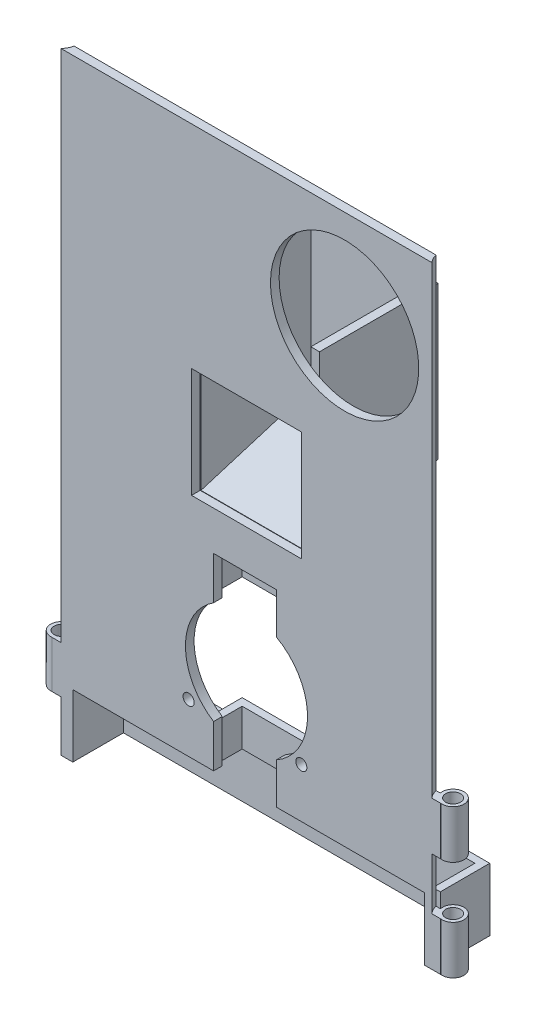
ISO-10303-21;
HEADER;
FILE_DESCRIPTION(('STEP AP214'),'2;1');
FILE_NAME('part.step','',(''),(''),'','','');
FILE_SCHEMA(('AUTOMOTIVE_DESIGN { 1 0 10303 214 1 1 1 1 }'));
ENDSEC;
DATA;
#1=APPLICATION_CONTEXT('core data for automotive mechanical design processes');
#2=APPLICATION_PROTOCOL_DEFINITION('international standard','automotive_design',2000,#1);
#3=PRODUCT_CONTEXT('',#1,'mechanical');
#4=PRODUCT('Part','Part','',(#3));
#5=PRODUCT_RELATED_PRODUCT_CATEGORY('part','',(#4));
#6=PRODUCT_DEFINITION_FORMATION('','',#4);
#7=PRODUCT_DEFINITION_CONTEXT('part definition',#1,'design');
#8=PRODUCT_DEFINITION('design','',#6,#7);
#9=PRODUCT_DEFINITION_SHAPE('','',#8);
#10=(LENGTH_UNIT() NAMED_UNIT(*) SI_UNIT(.MILLI.,.METRE.));
#11=(NAMED_UNIT(*) PLANE_ANGLE_UNIT() SI_UNIT($,.RADIAN.));
#12=(NAMED_UNIT(*) SI_UNIT($,.STERADIAN.) SOLID_ANGLE_UNIT());
#13=UNCERTAINTY_MEASURE_WITH_UNIT(LENGTH_MEASURE(1.E-05),#10,'distance_accuracy_value','');
#14=(GEOMETRIC_REPRESENTATION_CONTEXT(3) GLOBAL_UNCERTAINTY_ASSIGNED_CONTEXT((#13)) GLOBAL_UNIT_ASSIGNED_CONTEXT((#10,
#11,#12)) REPRESENTATION_CONTEXT('',''));
#15=CARTESIAN_POINT('',(0.,0.,0.));
#16=DIRECTION('',(0.,0.,1.));
#17=DIRECTION('',(1.,0.,0.));
#18=AXIS2_PLACEMENT_3D('',#15,#16,#17);
#19=CARTESIAN_POINT('',(0.,0.,0.));
#20=DIRECTION('',(0.,0.,-1.));
#21=DIRECTION('',(-1.,0.,0.));
#22=AXIS2_PLACEMENT_3D('',#19,#20,#21);
#23=PLANE('',#22);
#24=CARTESIAN_POINT('',(40.3061004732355,18.16,0.));
#25=DIRECTION('',(0.,0.,-1.));
#26=DIRECTION('',(-1.,0.,0.));
#27=AXIS2_PLACEMENT_3D('',#24,#25,#26);
#28=CIRCLE('',#27,0.899999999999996);
#29=CARTESIAN_POINT('',(39.4061004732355,18.16,0.));
#30=VERTEX_POINT('',#29);
#31=EDGE_CURVE('E1128',#30,#30,#28,.T.);
#32=ORIENTED_EDGE('',*,*,#31,.F.);
#33=EDGE_LOOP('',(#32));
#34=FACE_BOUND('',#33,.T.);
#35=CARTESIAN_POINT('',(22.0683539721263,18.16,0.));
#36=DIRECTION('',(0.,0.,-1.));
#37=DIRECTION('',(-1.,0.,0.));
#38=AXIS2_PLACEMENT_3D('',#35,#36,#37);
#39=CIRCLE('',#38,0.899999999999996);
#40=CARTESIAN_POINT('',(21.1683539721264,18.16,0.));
#41=VERTEX_POINT('',#40);
#42=EDGE_CURVE('E1130',#41,#41,#39,.T.);
#43=ORIENTED_EDGE('',*,*,#42,.F.);
#44=EDGE_LOOP('',(#43));
#45=FACE_BOUND('',#44,.T.);
#46=DIRECTION('',(-1.,0.,0.));
#47=VECTOR('',#46,1.);
#48=CARTESIAN_POINT('',(38.0434592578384,10.3393671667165,0.));
#49=LINE('',#48,#47);
#50=CARTESIAN_POINT('',(25.5309951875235,10.3393671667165,0.));
#51=VERTEX_POINT('',#50);
#52=CARTESIAN_POINT('',(24.3309951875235,10.3393671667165,0.));
#53=VERTEX_POINT('',#52);
#54=EDGE_CURVE('E569',#51,#53,#49,.T.);
#55=ORIENTED_EDGE('',*,*,#54,.F.);
#56=DIRECTION('',(0.,1.,0.));
#57=VECTOR('',#56,1.);
#58=CARTESIAN_POINT('',(25.5309951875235,0.,0.));
#59=LINE('',#58,#57);
#60=CARTESIAN_POINT('',(25.5309951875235,16.3393671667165,0.));
#61=VERTEX_POINT('',#60);
#62=EDGE_CURVE('E58',#51,#61,#59,.T.);
#63=ORIENTED_EDGE('',*,*,#62,.T.);
#64=DIRECTION('',(1.,0.,0.));
#65=VECTOR('',#64,1.);
#66=CARTESIAN_POINT('',(38.0434592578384,16.3393671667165,0.));
#67=LINE('',#66,#65);
#68=CARTESIAN_POINT('',(24.3309951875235,16.3393671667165,0.));
#69=VERTEX_POINT('',#68);
#70=EDGE_CURVE('E560',#69,#61,#67,.T.);
#71=ORIENTED_EDGE('',*,*,#70,.F.);
#72=DIRECTION('',(0.,1.,0.));
#73=VECTOR('',#72,1.);
#74=CARTESIAN_POINT('',(24.3309951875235,10.3393671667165,0.));
#75=LINE('',#74,#73);
#76=EDGE_CURVE('E573',#53,#69,#75,.T.);
#77=ORIENTED_EDGE('',*,*,#76,.F.);
#78=EDGE_LOOP('',(#55,#63,#71,#77));
#79=FACE_BOUND('',#78,.T.);
#80=DIRECTION('',(-1.,0.,0.));
#81=VECTOR('',#80,1.);
#82=CARTESIAN_POINT('',(38.0434592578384,34.4606328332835,0.));
#83=LINE('',#82,#81);
#84=CARTESIAN_POINT('',(25.5309951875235,34.4606328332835,0.));
#85=VERTEX_POINT('',#84);
#86=CARTESIAN_POINT('',(24.3309951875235,34.4606328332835,0.));
#87=VERTEX_POINT('',#86);
#88=EDGE_CURVE('E608',#85,#87,#83,.T.);
#89=ORIENTED_EDGE('',*,*,#88,.F.);
#90=CARTESIAN_POINT('',(25.5309951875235,40.4606328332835,0.));
#91=VERTEX_POINT('',#90);
#92=EDGE_CURVE('E527',#85,#91,#59,.T.);
#93=ORIENTED_EDGE('',*,*,#92,.T.);
#94=DIRECTION('',(1.,0.,0.));
#95=VECTOR('',#94,1.);
#96=CARTESIAN_POINT('',(38.0434592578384,40.4606328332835,0.));
#97=LINE('',#96,#95);
#98=CARTESIAN_POINT('',(24.3309951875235,40.4606328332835,0.));
#99=VERTEX_POINT('',#98);
#100=EDGE_CURVE('E603',#99,#91,#97,.T.);
#101=ORIENTED_EDGE('',*,*,#100,.F.);
#102=DIRECTION('',(0.,1.,0.));
#103=VECTOR('',#102,1.);
#104=CARTESIAN_POINT('',(24.3309951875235,40.4606328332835,0.));
#105=LINE('',#104,#103);
#106=EDGE_CURVE('E588',#87,#99,#105,.T.);
#107=ORIENTED_EDGE('',*,*,#106,.F.);
#108=EDGE_LOOP('',(#89,#93,#101,#107));
#109=FACE_BOUND('',#108,.T.);
#110=CARTESIAN_POINT('',(36.8434592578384,16.3393671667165,0.));
#111=VERTEX_POINT('',#110);
#112=CARTESIAN_POINT('',(38.0434592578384,16.3393671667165,0.));
#113=VERTEX_POINT('',#112);
#114=EDGE_CURVE('E575',#111,#113,#67,.T.);
#115=ORIENTED_EDGE('',*,*,#114,.F.);
#116=DIRECTION('',(0.,1.,0.));
#117=VECTOR('',#116,1.);
#118=CARTESIAN_POINT('',(36.8434592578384,0.,0.));
#119=LINE('',#118,#117);
#120=CARTESIAN_POINT('',(36.8434592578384,10.3393671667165,0.));
#121=VERTEX_POINT('',#120);
#122=EDGE_CURVE('E534',#121,#111,#119,.T.);
#123=ORIENTED_EDGE('',*,*,#122,.F.);
#124=CARTESIAN_POINT('',(38.0434592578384,10.3393671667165,0.));
#125=VERTEX_POINT('',#124);
#126=EDGE_CURVE('E570',#125,#121,#49,.T.);
#127=ORIENTED_EDGE('',*,*,#126,.F.);
#128=DIRECTION('',(0.,-1.,0.));
#129=VECTOR('',#128,1.);
#130=CARTESIAN_POINT('',(38.0434592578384,10.3393671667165,0.));
#131=LINE('',#130,#129);
#132=EDGE_CURVE('E555',#113,#125,#131,.T.);
#133=ORIENTED_EDGE('',*,*,#132,.F.);
#134=EDGE_LOOP('',(#115,#123,#127,#133));
#135=FACE_BOUND('',#134,.T.);
#136=CARTESIAN_POINT('',(36.8434592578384,34.4606328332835,0.));
#137=VERTEX_POINT('',#136);
#138=CARTESIAN_POINT('',(36.8434592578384,40.4606328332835,0.));
#139=VERTEX_POINT('',#138);
#140=EDGE_CURVE('E50',#137,#139,#119,.T.);
#141=ORIENTED_EDGE('',*,*,#140,.F.);
#142=CARTESIAN_POINT('',(38.0434592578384,34.4606328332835,0.));
#143=VERTEX_POINT('',#142);
#144=EDGE_CURVE('E593',#143,#137,#83,.T.);
#145=ORIENTED_EDGE('',*,*,#144,.F.);
#146=DIRECTION('',(0.,-1.,0.));
#147=VECTOR('',#146,1.);
#148=CARTESIAN_POINT('',(38.0434592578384,40.4606328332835,0.));
#149=LINE('',#148,#147);
#150=CARTESIAN_POINT('',(38.0434592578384,40.4606328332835,0.));
#151=VERTEX_POINT('',#150);
#152=EDGE_CURVE('E606',#151,#143,#149,.T.);
#153=ORIENTED_EDGE('',*,*,#152,.F.);
#154=EDGE_CURVE('E602',#139,#151,#97,.T.);
#155=ORIENTED_EDGE('',*,*,#154,.F.);
#156=EDGE_LOOP('',(#141,#145,#153,#155));
#157=FACE_BOUND('',#156,.T.);
#158=DIRECTION('',(-1.,0.,0.));
#159=VECTOR('',#158,1.);
#160=CARTESIAN_POINT('',(41.8497981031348,45.59,0.));
#161=LINE('',#160,#159);
#162=CARTESIAN_POINT('',(41.8497981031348,45.59,0.));
#163=VERTEX_POINT('',#162);
#164=CARTESIAN_POINT('',(21.2697981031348,45.59,0.));
#165=VERTEX_POINT('',#164);
#166=EDGE_CURVE('E664',#163,#165,#161,.T.);
#167=ORIENTED_EDGE('',*,*,#166,.F.);
#168=DIRECTION('',(0.,-1.,0.));
#169=VECTOR('',#168,1.);
#170=CARTESIAN_POINT('',(41.8497981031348,76.07,0.));
#171=LINE('',#170,#169);
#172=CARTESIAN_POINT('',(41.8497981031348,72.4954837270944,0.));
#173=VERTEX_POINT('',#172);
#174=EDGE_CURVE('E676',#173,#163,#171,.T.);
#175=ORIENTED_EDGE('',*,*,#174,.F.);
#176=CARTESIAN_POINT('',(47.3125,83.18,0.));
#177=DIRECTION('',(0.,0.,-1.));
#178=DIRECTION('',(-1.,0.,0.));
#179=AXIS2_PLACEMENT_3D('',#176,#177,#178);
#180=CIRCLE('',#179,12.);
#181=CARTESIAN_POINT('',(40.4497981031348,73.3360514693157,0.));
#182=VERTEX_POINT('',#181);
#183=EDGE_CURVE('E785',#182,#173,#180,.T.);
#184=ORIENTED_EDGE('',*,*,#183,.F.);
#185=DIRECTION('',(0.,1.,0.));
#186=VECTOR('',#185,1.);
#187=CARTESIAN_POINT('',(40.4497981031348,22.646312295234,0.));
#188=LINE('',#187,#186);
#189=CARTESIAN_POINT('',(40.4497981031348,47.0535015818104,0.));
#190=VERTEX_POINT('',#189);
#191=EDGE_CURVE('E642',#190,#182,#188,.T.);
#192=ORIENTED_EDGE('',*,*,#191,.F.);
#193=DIRECTION('',(-1.,0.,0.));
#194=VECTOR('',#193,1.);
#195=CARTESIAN_POINT('',(22.6697981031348,47.0535015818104,0.));
#196=LINE('',#195,#194);
#197=CARTESIAN_POINT('',(40.3225,47.0535015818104,0.));
#198=VERTEX_POINT('',#197);
#199=EDGE_CURVE('E648',#190,#198,#196,.T.);
#200=ORIENTED_EDGE('',*,*,#199,.T.);
#201=DIRECTION('',(0.,-1.,0.));
#202=VECTOR('',#201,1.);
#203=CARTESIAN_POINT('',(40.3225,64.77,0.));
#204=LINE('',#203,#202);
#205=CARTESIAN_POINT('',(40.3225,64.77,0.));
#206=VERTEX_POINT('',#205);
#207=EDGE_CURVE('E794',#206,#198,#204,.T.);
#208=ORIENTED_EDGE('',*,*,#207,.F.);
#209=DIRECTION('',(1.,0.,0.));
#210=VECTOR('',#209,1.);
#211=CARTESIAN_POINT('',(40.3225,64.77,0.));
#212=LINE('',#211,#210);
#213=CARTESIAN_POINT('',(22.6697981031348,64.77,0.));
#214=VERTEX_POINT('',#213);
#215=EDGE_CURVE('E651',#214,#206,#212,.T.);
#216=ORIENTED_EDGE('',*,*,#215,.F.);
#217=DIRECTION('',(0.,1.,0.));
#218=VECTOR('',#217,1.);
#219=CARTESIAN_POINT('',(22.6697981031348,22.646312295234,0.));
#220=LINE('',#219,#218);
#221=CARTESIAN_POINT('',(22.6697981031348,76.07,0.));
#222=VERTEX_POINT('',#221);
#223=EDGE_CURVE('E638',#214,#222,#220,.T.);
#224=ORIENTED_EDGE('',*,*,#223,.T.);
#225=DIRECTION('',(1.,0.,0.));
#226=VECTOR('',#225,1.);
#227=CARTESIAN_POINT('',(41.8497981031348,76.07,0.));
#228=LINE('',#227,#226);
#229=CARTESIAN_POINT('',(21.2697981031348,76.07,0.));
#230=VERTEX_POINT('',#229);
#231=EDGE_CURVE('E673',#230,#222,#228,.T.);
#232=ORIENTED_EDGE('',*,*,#231,.F.);
#233=DIRECTION('',(0.,1.,0.));
#234=VECTOR('',#233,1.);
#235=CARTESIAN_POINT('',(21.2697981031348,76.07,0.));
#236=LINE('',#235,#234);
#237=EDGE_CURVE('E660',#165,#230,#236,.T.);
#238=ORIENTED_EDGE('',*,*,#237,.F.);
#239=EDGE_LOOP('',(#167,#175,#184,#192,#200,#208,#216,#224,#232,#238));
#240=FACE_BOUND('',#239,.T.);
#241=DIRECTION('',(0.,-1.,0.));
#242=VECTOR('',#241,1.);
#243=CARTESIAN_POINT('',(60.7406579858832,16.2,0.));
#244=LINE('',#243,#242);
#245=CARTESIAN_POINT('',(60.7406579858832,16.2,0.));
#246=VERTEX_POINT('',#245);
#247=CARTESIAN_POINT('',(60.7406579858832,10.16,0.));
#248=VERTEX_POINT('',#247);
#249=EDGE_CURVE('E777',#246,#248,#244,.T.);
#250=ORIENTED_EDGE('',*,*,#249,.T.);
#251=DIRECTION('',(1.,0.,0.));
#252=VECTOR('',#251,1.);
#253=CARTESIAN_POINT('',(61.4003571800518,10.16,0.));
#254=LINE('',#253,#252);
#255=CARTESIAN_POINT('',(60.2003571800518,10.16,0.));
#256=VERTEX_POINT('',#255);
#257=EDGE_CURVE('E500',#256,#248,#254,.T.);
#258=ORIENTED_EDGE('',*,*,#257,.F.);
#259=CARTESIAN_POINT('',(36.2672272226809,10.16,0.));
#260=VERTEX_POINT('',#259);
#261=EDGE_CURVE('E499',#260,#256,#254,.T.);
#262=ORIENTED_EDGE('',*,*,#261,.F.);
#263=DIRECTION('',(0.,-1.,0.));
#264=VECTOR('',#263,1.);
#265=CARTESIAN_POINT('',(36.2672272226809,16.7864293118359,0.));
#266=LINE('',#265,#264);
#267=CARTESIAN_POINT('',(36.2672272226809,16.7864293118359,0.));
#268=VERTEX_POINT('',#267);
#269=EDGE_CURVE('E824',#268,#260,#266,.T.);
#270=ORIENTED_EDGE('',*,*,#269,.F.);
#271=CARTESIAN_POINT('',(31.4325,25.4,0.));
#272=DIRECTION('',(0.,0.,-1.));
#273=DIRECTION('',(-1.,0.,0.));
#274=AXIS2_PLACEMENT_3D('',#271,#272,#273);
#275=CIRCLE('',#274,9.87766102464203);
#276=CARTESIAN_POINT('',(36.267227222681,34.0135706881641,0.));
#277=VERTEX_POINT('',#276);
#278=EDGE_CURVE('E822',#277,#268,#275,.T.);
#279=ORIENTED_EDGE('',*,*,#278,.F.);
#280=DIRECTION('',(0.,-1.,0.));
#281=VECTOR('',#280,1.);
#282=CARTESIAN_POINT('',(36.2672272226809,40.64,0.));
#283=LINE('',#282,#281);
#284=CARTESIAN_POINT('',(36.2672272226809,40.64,0.));
#285=VERTEX_POINT('',#284);
#286=EDGE_CURVE('E820',#285,#277,#283,.T.);
#287=ORIENTED_EDGE('',*,*,#286,.F.);
#288=DIRECTION('',(1.,0.,0.));
#289=VECTOR('',#288,1.);
#290=CARTESIAN_POINT('',(36.2672272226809,40.64,0.));
#291=LINE('',#290,#289);
#292=CARTESIAN_POINT('',(26.1072272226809,40.64,0.));
#293=VERTEX_POINT('',#292);
#294=EDGE_CURVE('E817',#293,#285,#291,.T.);
#295=ORIENTED_EDGE('',*,*,#294,.F.);
#296=DIRECTION('',(0.,1.,0.));
#297=VECTOR('',#296,1.);
#298=CARTESIAN_POINT('',(26.1072272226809,40.64,0.));
#299=LINE('',#298,#297);
#300=CARTESIAN_POINT('',(26.1072272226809,33.7192341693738,0.));
#301=VERTEX_POINT('',#300);
#302=EDGE_CURVE('E815',#301,#293,#299,.T.);
#303=ORIENTED_EDGE('',*,*,#302,.F.);
#304=CARTESIAN_POINT('',(31.4325,25.4,0.));
#305=DIRECTION('',(0.,0.,-1.));
#306=DIRECTION('',(-1.,0.,0.));
#307=AXIS2_PLACEMENT_3D('',#304,#305,#306);
#308=CIRCLE('',#307,9.87766102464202);
#309=CARTESIAN_POINT('',(26.1072272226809,17.0807658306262,0.));
#310=VERTEX_POINT('',#309);
#311=EDGE_CURVE('E813',#310,#301,#308,.T.);
#312=ORIENTED_EDGE('',*,*,#311,.F.);
#313=DIRECTION('',(0.,1.,0.));
#314=VECTOR('',#313,1.);
#315=CARTESIAN_POINT('',(26.1072272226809,17.0807658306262,0.));
#316=LINE('',#315,#314);
#317=CARTESIAN_POINT('',(26.1072272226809,10.16,0.));
#318=VERTEX_POINT('',#317);
#319=EDGE_CURVE('E780',#318,#310,#316,.T.);
#320=ORIENTED_EDGE('',*,*,#319,.F.);
#321=DIRECTION('',(-1.,0.,0.));
#322=VECTOR('',#321,1.);
#323=CARTESIAN_POINT('',(0.,10.16,0.));
#324=LINE('',#323,#322);
#325=CARTESIAN_POINT('',(3.32434201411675,10.16,0.));
#326=VERTEX_POINT('',#325);
#327=EDGE_CURVE('E474',#318,#326,#324,.T.);
#328=ORIENTED_EDGE('',*,*,#327,.T.);
#329=CARTESIAN_POINT('',(2.12434201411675,10.16,0.));
#330=VERTEX_POINT('',#329);
#331=EDGE_CURVE('E496',#330,#326,#254,.T.);
#332=ORIENTED_EDGE('',*,*,#331,.F.);
#333=DIRECTION('',(0.,1.,0.));
#334=VECTOR('',#333,1.);
#335=CARTESIAN_POINT('',(2.12434201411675,10.16,0.));
#336=LINE('',#335,#334);
#337=CARTESIAN_POINT('',(2.12434201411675,8.2,0.));
#338=VERTEX_POINT('',#337);
#339=EDGE_CURVE('E482',#338,#330,#336,.T.);
#340=ORIENTED_EDGE('',*,*,#339,.F.);
#341=DIRECTION('',(1.,0.,0.));
#342=VECTOR('',#341,1.);
#343=CARTESIAN_POINT('',(0.,8.2,0.));
#344=LINE('',#343,#342);
#345=CARTESIAN_POINT('',(1.46464281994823,8.2,0.));
#346=VERTEX_POINT('',#345);
#347=EDGE_CURVE('E721',#346,#338,#344,.T.);
#348=ORIENTED_EDGE('',*,*,#347,.F.);
#349=DIRECTION('',(0.,-1.,0.));
#350=VECTOR('',#349,1.);
#351=CARTESIAN_POINT('',(1.46464281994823,104.009747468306,0.));
#352=LINE('',#351,#350);
#353=CARTESIAN_POINT('',(1.46464281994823,15.8,0.));
#354=VERTEX_POINT('',#353);
#355=EDGE_CURVE('E880',#346,#354,#352,.F.);
#356=ORIENTED_EDGE('',*,*,#355,.T.);
#357=DIRECTION('',(1.,0.,0.));
#358=VECTOR('',#357,1.);
#359=CARTESIAN_POINT('',(0.,15.8,0.));
#360=LINE('',#359,#358);
#361=CARTESIAN_POINT('',(2.12434201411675,15.8,0.));
#362=VERTEX_POINT('',#361);
#363=EDGE_CURVE('E698',#354,#362,#360,.T.);
#364=ORIENTED_EDGE('',*,*,#363,.T.);
#365=DIRECTION('',(0.,-1.,0.));
#366=VECTOR('',#365,1.);
#367=CARTESIAN_POINT('',(2.12434201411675,105.848225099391,0.));
#368=LINE('',#367,#366);
#369=CARTESIAN_POINT('',(2.12434201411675,99.06,0.));
#370=VERTEX_POINT('',#369);
#371=EDGE_CURVE('E703',#362,#370,#368,.F.);
#372=ORIENTED_EDGE('',*,*,#371,.T.);
#373=DIRECTION('',(-1.,0.,0.));
#374=VECTOR('',#373,1.);
#375=CARTESIAN_POINT('',(0.,99.06,0.));
#376=LINE('',#375,#374);
#377=CARTESIAN_POINT('',(60.7406579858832,99.06,0.));
#378=VERTEX_POINT('',#377);
#379=EDGE_CURVE('E862',#378,#370,#376,.T.);
#380=ORIENTED_EDGE('',*,*,#379,.F.);
#381=DIRECTION('',(0.,-1.,0.));
#382=VECTOR('',#381,1.);
#383=CARTESIAN_POINT('',(60.7406579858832,105.848225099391,0.));
#384=LINE('',#383,#382);
#385=CARTESIAN_POINT('',(60.7406579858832,24.,0.));
#386=VERTEX_POINT('',#385);
#387=EDGE_CURVE('E746',#378,#386,#384,.T.);
#388=ORIENTED_EDGE('',*,*,#387,.T.);
#389=DIRECTION('',(1.,0.,0.));
#390=VECTOR('',#389,1.);
#391=CARTESIAN_POINT('',(0.,24.,0.));
#392=LINE('',#391,#390);
#393=CARTESIAN_POINT('',(61.4003571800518,24.,0.));
#394=VERTEX_POINT('',#393);
#395=EDGE_CURVE('E741',#386,#394,#392,.T.);
#396=ORIENTED_EDGE('',*,*,#395,.T.);
#397=DIRECTION('',(0.,-1.,0.));
#398=VECTOR('',#397,1.);
#399=CARTESIAN_POINT('',(61.4003571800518,104.009747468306,0.));
#400=LINE('',#399,#398);
#401=CARTESIAN_POINT('',(61.4003571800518,16.2,0.));
#402=VERTEX_POINT('',#401);
#403=EDGE_CURVE('E857',#394,#402,#400,.T.);
#404=ORIENTED_EDGE('',*,*,#403,.T.);
#405=DIRECTION('',(1.,0.,0.));
#406=VECTOR('',#405,1.);
#407=CARTESIAN_POINT('',(0.,16.2,0.));
#408=LINE('',#407,#406);
#409=EDGE_CURVE('E771',#246,#402,#408,.T.);
#410=ORIENTED_EDGE('',*,*,#409,.F.);
#411=EDGE_LOOP('',(#250,#258,#262,#270,#279,#287,#295,#303,#312,#320,#328,#332,#340,#348,#356,
#364,#372,#380,#388,#396,#404,#410));
#412=FACE_BOUND('',#411,.T.);
#413=ADVANCED_FACE('F35',(#34,#45,#79,#109,#135,#157,#240,#412),#23,.T.);
#414=CARTESIAN_POINT('',(63.115,104.009747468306,-0.349999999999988));
#415=DIRECTION('',(0.,-1.,0.));
#416=DIRECTION('',(0.,0.,-1.));
#417=AXIS2_PLACEMENT_3D('',#414,#415,#416);
#418=CYLINDRICAL_SURFACE('',#417,1.75);
#419=DIRECTION('',(0.,-1.,0.));
#420=VECTOR('',#419,1.);
#421=CARTESIAN_POINT('',(61.4003571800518,104.009747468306,-0.699999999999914));
#422=LINE('',#421,#420);
#423=CARTESIAN_POINT('',(61.4003571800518,7.8,-0.699999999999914));
#424=VERTEX_POINT('',#423);
#425=CARTESIAN_POINT('',(61.4003571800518,0.,-0.699999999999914));
#426=VERTEX_POINT('',#425);
#427=EDGE_CURVE('E516',#424,#426,#422,.T.);
#428=ORIENTED_EDGE('',*,*,#427,.F.);
#429=CARTESIAN_POINT('',(63.115,7.8,-0.349999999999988));
#430=DIRECTION('',(0.,1.,0.));
#431=DIRECTION('',(0.,0.,1.));
#432=AXIS2_PLACEMENT_3D('',#429,#430,#431);
#433=CIRCLE('',#432,1.75);
#434=CARTESIAN_POINT('',(62.865,7.8,1.38205080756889));
#435=VERTEX_POINT('',#434);
#436=EDGE_CURVE('E755',#435,#424,#433,.T.);
#437=ORIENTED_EDGE('',*,*,#436,.F.);
#438=DIRECTION('',(0.,-1.,0.));
#439=VECTOR('',#438,1.);
#440=CARTESIAN_POINT('',(62.865,104.009747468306,1.38205080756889));
#441=LINE('',#440,#439);
#442=CARTESIAN_POINT('',(62.865,0.,1.38205080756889));
#443=VERTEX_POINT('',#442);
#444=EDGE_CURVE('E854',#435,#443,#441,.T.);
#445=ORIENTED_EDGE('',*,*,#444,.T.);
#446=CARTESIAN_POINT('',(63.115,0.,-0.349999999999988));
#447=DIRECTION('',(0.,1.,0.));
#448=DIRECTION('',(0.,0.,-1.));
#449=AXIS2_PLACEMENT_3D('',#446,#447,#448);
#450=CIRCLE('',#449,1.75);
#451=EDGE_CURVE('E851',#443,#426,#450,.T.);
#452=ORIENTED_EDGE('',*,*,#451,.T.);
#453=EDGE_LOOP('',(#428,#437,#445,#452));
#454=FACE_BOUND('',#453,.T.);
#455=ADVANCED_FACE('F984',(#454),#418,.T.);
#456=CARTESIAN_POINT('',(63.115,7.8,-0.349999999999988));
#457=DIRECTION('',(0.,1.,0.));
#458=DIRECTION('',(0.,0.,1.));
#459=AXIS2_PLACEMENT_3D('',#456,#457,#458);
#460=PLANE('',#459);
#461=CARTESIAN_POINT('',(63.115,7.8,-0.349999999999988));
#462=DIRECTION('',(0.,1.,0.));
#463=DIRECTION('',(0.,0.,1.));
#464=AXIS2_PLACEMENT_3D('',#461,#462,#463);
#465=CIRCLE('',#464,1.19999999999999);
#466=CARTESIAN_POINT('',(63.115,7.8,0.849999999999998));
#467=VERTEX_POINT('',#466);
#468=EDGE_CURVE('E754',#467,#467,#465,.F.);
#469=ORIENTED_EDGE('',*,*,#468,.T.);
#470=EDGE_LOOP('',(#469));
#471=FACE_BOUND('',#470,.T.);
#472=ORIENTED_EDGE('',*,*,#436,.T.);
#473=DIRECTION('',(0.,0.,1.));
#474=VECTOR('',#473,1.);
#475=CARTESIAN_POINT('',(61.4003571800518,7.8,-0.349999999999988));
#476=LINE('',#475,#474);
#477=CARTESIAN_POINT('',(61.4003571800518,7.8,0.));
#478=VERTEX_POINT('',#477);
#479=EDGE_CURVE('E12',#424,#478,#476,.T.);
#480=ORIENTED_EDGE('',*,*,#479,.T.);
#481=DIRECTION('',(1.,0.,0.));
#482=VECTOR('',#481,1.);
#483=CARTESIAN_POINT('',(0.,7.8,0.));
#484=LINE('',#483,#482);
#485=CARTESIAN_POINT('',(60.7406579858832,7.8,0.));
#486=VERTEX_POINT('',#485);
#487=EDGE_CURVE('E760',#486,#478,#484,.T.);
#488=ORIENTED_EDGE('',*,*,#487,.F.);
#489=CARTESIAN_POINT('',(63.115,7.8,-0.349999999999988));
#490=DIRECTION('',(0.,1.,0.));
#491=DIRECTION('',(0.,0.,1.));
#492=AXIS2_PLACEMENT_3D('',#489,#490,#491);
#493=CIRCLE('',#492,2.4);
#494=CARTESIAN_POINT('',(61.4725932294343,7.8,1.4));
#495=VERTEX_POINT('',#494);
#496=EDGE_CURVE('E748',#486,#495,#493,.T.);
#497=ORIENTED_EDGE('',*,*,#496,.T.);
#498=DIRECTION('',(1.,0.,0.));
#499=VECTOR('',#498,1.);
#500=CARTESIAN_POINT('',(0.,7.8,1.4));
#501=LINE('',#500,#499);
#502=CARTESIAN_POINT('',(62.865,7.8,1.4));
#503=VERTEX_POINT('',#502);
#504=EDGE_CURVE('E762',#495,#503,#501,.T.);
#505=ORIENTED_EDGE('',*,*,#504,.T.);
#506=DIRECTION('',(0.,0.,-1.));
#507=VECTOR('',#506,1.);
#508=CARTESIAN_POINT('',(62.865,7.8,1.4));
#509=LINE('',#508,#507);
#510=EDGE_CURVE('E758',#503,#435,#509,.T.);
#511=ORIENTED_EDGE('',*,*,#510,.T.);
#512=EDGE_LOOP('',(#472,#480,#488,#497,#505,#511));
#513=FACE_BOUND('',#512,.T.);
#514=ADVANCED_FACE('F992',(#471,#513),#460,.T.);
#515=CARTESIAN_POINT('',(0.,0.,1.4));
#516=DIRECTION('',(0.,0.,-1.));
#517=DIRECTION('',(-1.,0.,0.));
#518=AXIS2_PLACEMENT_3D('',#515,#516,#517);
#519=PLANE('',#518);
#520=CARTESIAN_POINT('',(40.3061004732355,18.16,1.4));
#521=DIRECTION('',(0.,0.,1.));
#522=DIRECTION('',(1.,0.,0.));
#523=AXIS2_PLACEMENT_3D('',#520,#521,#522);
#524=CIRCLE('',#523,0.899999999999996);
#525=CARTESIAN_POINT('',(41.2061004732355,18.16,1.4));
#526=VERTEX_POINT('',#525);
#527=EDGE_CURVE('E1134',#526,#526,#524,.T.);
#528=ORIENTED_EDGE('',*,*,#527,.F.);
#529=EDGE_LOOP('',(#528));
#530=FACE_BOUND('',#529,.T.);
#531=CARTESIAN_POINT('',(22.0683539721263,18.16,1.4));
#532=DIRECTION('',(0.,0.,1.));
#533=DIRECTION('',(-1.,0.,0.));
#534=AXIS2_PLACEMENT_3D('',#531,#532,#533);
#535=CIRCLE('',#534,0.899999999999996);
#536=CARTESIAN_POINT('',(21.1683539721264,18.16,1.4));
#537=VERTEX_POINT('',#536);
#538=EDGE_CURVE('E1812',#537,#537,#535,.T.);
#539=ORIENTED_EDGE('',*,*,#538,.F.);
#540=EDGE_LOOP('',(#539));
#541=FACE_BOUND('',#540,.T.);
#542=CARTESIAN_POINT('',(47.3125,83.18,1.4));
#543=DIRECTION('',(0.,0.,-1.));
#544=DIRECTION('',(-1.,0.,0.));
#545=AXIS2_PLACEMENT_3D('',#542,#543,#544);
#546=CIRCLE('',#545,12.);
#547=CARTESIAN_POINT('',(35.3125,83.18,1.4));
#548=VERTEX_POINT('',#547);
#549=EDGE_CURVE('E784',#548,#548,#546,.T.);
#550=ORIENTED_EDGE('',*,*,#549,.T.);
#551=EDGE_LOOP('',(#550));
#552=FACE_BOUND('',#551,.T.);
#553=DIRECTION('',(-1.,0.,0.));
#554=VECTOR('',#553,1.);
#555=CARTESIAN_POINT('',(0.,46.99,1.4));
#556=LINE('',#555,#554);
#557=CARTESIAN_POINT('',(40.3225,46.99,1.4));
#558=VERTEX_POINT('',#557);
#559=CARTESIAN_POINT('',(22.5425,46.99,1.4));
#560=VERTEX_POINT('',#559);
#561=EDGE_CURVE('E910',#558,#560,#556,.T.);
#562=ORIENTED_EDGE('',*,*,#561,.T.);
#563=DIRECTION('',(0.,1.,0.));
#564=VECTOR('',#563,1.);
#565=CARTESIAN_POINT('',(22.5425,0.,1.4));
#566=LINE('',#565,#564);
#567=CARTESIAN_POINT('',(22.5425,64.77,1.4));
#568=VERTEX_POINT('',#567);
#569=EDGE_CURVE('E913',#560,#568,#566,.T.);
#570=ORIENTED_EDGE('',*,*,#569,.T.);
#571=DIRECTION('',(1.,0.,0.));
#572=VECTOR('',#571,1.);
#573=CARTESIAN_POINT('',(0.,64.77,1.4));
#574=LINE('',#573,#572);
#575=CARTESIAN_POINT('',(40.3225,64.77,1.4));
#576=VERTEX_POINT('',#575);
#577=EDGE_CURVE('E904',#568,#576,#574,.T.);
#578=ORIENTED_EDGE('',*,*,#577,.T.);
#579=DIRECTION('',(0.,-1.,0.));
#580=VECTOR('',#579,1.);
#581=CARTESIAN_POINT('',(40.3225,0.,1.4));
#582=LINE('',#581,#580);
#583=EDGE_CURVE('E907',#576,#558,#582,.T.);
#584=ORIENTED_EDGE('',*,*,#583,.T.);
#585=EDGE_LOOP('',(#562,#570,#578,#584));
#586=FACE_BOUND('',#585,.T.);
#587=DIRECTION('',(-1.,0.,0.));
#588=VECTOR('',#587,1.);
#589=CARTESIAN_POINT('',(0.,10.16,1.4));
#590=LINE('',#589,#588);
#591=CARTESIAN_POINT('',(60.2003571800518,10.16,1.4));
#592=VERTEX_POINT('',#591);
#593=CARTESIAN_POINT('',(36.2672272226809,10.16,1.4));
#594=VERTEX_POINT('',#593);
#595=EDGE_CURVE('E471',#592,#594,#590,.T.);
#596=ORIENTED_EDGE('',*,*,#595,.F.);
#597=DIRECTION('',(0.,-1.,0.));
#598=VECTOR('',#597,1.);
#599=CARTESIAN_POINT('',(60.2003571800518,0.,1.4));
#600=LINE('',#599,#598);
#601=CARTESIAN_POINT('',(60.2003571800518,0.,1.40000000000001));
#602=VERTEX_POINT('',#601);
#603=EDGE_CURVE('E479',#592,#602,#600,.T.);
#604=ORIENTED_EDGE('',*,*,#603,.T.);
#605=DIRECTION('',(1.,0.,0.));
#606=VECTOR('',#605,1.);
#607=CARTESIAN_POINT('',(0.,0.,1.4));
#608=LINE('',#607,#606);
#609=CARTESIAN_POINT('',(62.865,0.,1.4));
#610=VERTEX_POINT('',#609);
#611=EDGE_CURVE('E865',#602,#610,#608,.T.);
#612=ORIENTED_EDGE('',*,*,#611,.T.);
#613=DIRECTION('',(0.,1.,0.));
#614=VECTOR('',#613,1.);
#615=CARTESIAN_POINT('',(62.865,0.,1.4));
#616=LINE('',#615,#614);
#617=EDGE_CURVE('E869',#610,#503,#616,.T.);
#618=ORIENTED_EDGE('',*,*,#617,.T.);
#619=ORIENTED_EDGE('',*,*,#504,.F.);
#620=DIRECTION('',(0.,-1.,0.));
#621=VECTOR('',#620,1.);
#622=CARTESIAN_POINT('',(61.4725932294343,16.2,1.4));
#623=LINE('',#622,#621);
#624=CARTESIAN_POINT('',(61.4725932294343,16.2,1.4));
#625=VERTEX_POINT('',#624);
#626=EDGE_CURVE('E916',#625,#495,#623,.T.);
#627=ORIENTED_EDGE('',*,*,#626,.F.);
#628=DIRECTION('',(1.,0.,0.));
#629=VECTOR('',#628,1.);
#630=CARTESIAN_POINT('',(0.,16.2,1.4));
#631=LINE('',#630,#629);
#632=CARTESIAN_POINT('',(62.865,16.2,1.4));
#633=VERTEX_POINT('',#632);
#634=EDGE_CURVE('E774',#625,#633,#631,.T.);
#635=ORIENTED_EDGE('',*,*,#634,.T.);
#636=CARTESIAN_POINT('',(62.865,24.,1.4));
#637=VERTEX_POINT('',#636);
#638=EDGE_CURVE('E868',#633,#637,#616,.T.);
#639=ORIENTED_EDGE('',*,*,#638,.T.);
#640=DIRECTION('',(1.,0.,0.));
#641=VECTOR('',#640,1.);
#642=CARTESIAN_POINT('',(0.,24.,1.4));
#643=LINE('',#642,#641);
#644=CARTESIAN_POINT('',(61.4725932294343,24.,1.4));
#645=VERTEX_POINT('',#644);
#646=EDGE_CURVE('E744',#645,#637,#643,.T.);
#647=ORIENTED_EDGE('',*,*,#646,.F.);
#648=DIRECTION('',(0.,-1.,0.));
#649=VECTOR('',#648,1.);
#650=CARTESIAN_POINT('',(61.4725932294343,105.848225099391,1.4));
#651=LINE('',#650,#649);
#652=CARTESIAN_POINT('',(61.4725932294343,99.06,1.4));
#653=VERTEX_POINT('',#652);
#654=EDGE_CURVE('E924',#653,#645,#651,.T.);
#655=ORIENTED_EDGE('',*,*,#654,.F.);
#656=DIRECTION('',(-1.,0.,0.));
#657=VECTOR('',#656,1.);
#658=CARTESIAN_POINT('',(0.,99.06,1.4));
#659=LINE('',#658,#657);
#660=CARTESIAN_POINT('',(1.3924067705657,99.06,1.4));
#661=VERTEX_POINT('',#660);
#662=EDGE_CURVE('E872',#653,#661,#659,.T.);
#663=ORIENTED_EDGE('',*,*,#662,.T.);
#664=DIRECTION('',(0.,-1.,0.));
#665=VECTOR('',#664,1.);
#666=CARTESIAN_POINT('',(1.3924067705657,105.848225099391,1.4));
#667=LINE('',#666,#665);
#668=CARTESIAN_POINT('',(1.3924067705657,15.8,1.4));
#669=VERTEX_POINT('',#668);
#670=EDGE_CURVE('E701',#669,#661,#667,.F.);
#671=ORIENTED_EDGE('',*,*,#670,.F.);
#672=DIRECTION('',(1.,0.,0.));
#673=VECTOR('',#672,1.);
#674=CARTESIAN_POINT('',(0.,15.8,1.4));
#675=LINE('',#674,#673);
#676=CARTESIAN_POINT('',(0.,15.8,1.4));
#677=VERTEX_POINT('',#676);
#678=EDGE_CURVE('E696',#677,#669,#675,.T.);
#679=ORIENTED_EDGE('',*,*,#678,.F.);
#680=DIRECTION('',(0.,-1.,0.));
#681=VECTOR('',#680,1.);
#682=CARTESIAN_POINT('',(0.,0.,1.4));
#683=LINE('',#682,#681);
#684=CARTESIAN_POINT('',(0.,8.2,1.4));
#685=VERTEX_POINT('',#684);
#686=EDGE_CURVE('E863',#677,#685,#683,.T.);
#687=ORIENTED_EDGE('',*,*,#686,.T.);
#688=DIRECTION('',(1.,0.,0.));
#689=VECTOR('',#688,1.);
#690=CARTESIAN_POINT('',(0.,8.2,1.4));
#691=LINE('',#690,#689);
#692=CARTESIAN_POINT('',(1.3924067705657,8.2,1.4));
#693=VERTEX_POINT('',#692);
#694=EDGE_CURVE('E718',#685,#693,#691,.T.);
#695=ORIENTED_EDGE('',*,*,#694,.T.);
#696=DIRECTION('',(0.,1.,0.));
#697=VECTOR('',#696,1.);
#698=CARTESIAN_POINT('',(1.3924067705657,-6.78822509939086,1.4));
#699=LINE('',#698,#697);
#700=CARTESIAN_POINT('',(1.3924067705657,0.,1.4));
#701=VERTEX_POINT('',#700);
#702=EDGE_CURVE('E724',#693,#701,#699,.F.);
#703=ORIENTED_EDGE('',*,*,#702,.T.);
#704=CARTESIAN_POINT('',(3.32434201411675,0.,1.40000000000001));
#705=VERTEX_POINT('',#704);
#706=EDGE_CURVE('E866',#701,#705,#608,.T.);
#707=ORIENTED_EDGE('',*,*,#706,.T.);
#708=DIRECTION('',(0.,1.,0.));
#709=VECTOR('',#708,1.);
#710=CARTESIAN_POINT('',(3.32434201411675,0.,1.4));
#711=LINE('',#710,#709);
#712=CARTESIAN_POINT('',(3.32434201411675,10.16,1.4));
#713=VERTEX_POINT('',#712);
#714=EDGE_CURVE('E446',#705,#713,#711,.T.);
#715=ORIENTED_EDGE('',*,*,#714,.T.);
#716=CARTESIAN_POINT('',(26.1072272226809,10.16,1.4));
#717=VERTEX_POINT('',#716);
#718=EDGE_CURVE('E473',#717,#713,#590,.T.);
#719=ORIENTED_EDGE('',*,*,#718,.F.);
#720=DIRECTION('',(0.,1.,0.));
#721=VECTOR('',#720,1.);
#722=CARTESIAN_POINT('',(26.1072272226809,0.,1.4));
#723=LINE('',#722,#721);
#724=CARTESIAN_POINT('',(26.1072272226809,17.0807658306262,1.4));
#725=VERTEX_POINT('',#724);
#726=EDGE_CURVE('E901',#717,#725,#723,.T.);
#727=ORIENTED_EDGE('',*,*,#726,.T.);
#728=CARTESIAN_POINT('',(31.4325,25.4,1.4));
#729=DIRECTION('',(0.,0.,-1.));
#730=DIRECTION('',(-1.,0.,0.));
#731=AXIS2_PLACEMENT_3D('',#728,#729,#730);
#732=CIRCLE('',#731,9.87766102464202);
#733=CARTESIAN_POINT('',(26.1072272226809,33.7192341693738,1.4));
#734=VERTEX_POINT('',#733);
#735=EDGE_CURVE('E883',#725,#734,#732,.T.);
#736=ORIENTED_EDGE('',*,*,#735,.T.);
#737=DIRECTION('',(0.,1.,0.));
#738=VECTOR('',#737,1.);
#739=CARTESIAN_POINT('',(26.1072272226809,0.,1.4));
#740=LINE('',#739,#738);
#741=CARTESIAN_POINT('',(26.1072272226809,40.64,1.4));
#742=VERTEX_POINT('',#741);
#743=EDGE_CURVE('E886',#734,#742,#740,.T.);
#744=ORIENTED_EDGE('',*,*,#743,.T.);
#745=DIRECTION('',(1.,0.,0.));
#746=VECTOR('',#745,1.);
#747=CARTESIAN_POINT('',(0.,40.64,1.4));
#748=LINE('',#747,#746);
#749=CARTESIAN_POINT('',(36.2672272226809,40.64,1.4));
#750=VERTEX_POINT('',#749);
#751=EDGE_CURVE('E889',#742,#750,#748,.T.);
#752=ORIENTED_EDGE('',*,*,#751,.T.);
#753=DIRECTION('',(0.,-1.,0.));
#754=VECTOR('',#753,1.);
#755=CARTESIAN_POINT('',(36.2672272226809,0.,1.4));
#756=LINE('',#755,#754);
#757=CARTESIAN_POINT('',(36.267227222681,34.0135706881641,1.4));
#758=VERTEX_POINT('',#757);
#759=EDGE_CURVE('E892',#750,#758,#756,.T.);
#760=ORIENTED_EDGE('',*,*,#759,.T.);
#761=CARTESIAN_POINT('',(31.4325,25.4,1.4));
#762=DIRECTION('',(0.,0.,-1.));
#763=DIRECTION('',(-1.,0.,0.));
#764=AXIS2_PLACEMENT_3D('',#761,#762,#763);
#765=CIRCLE('',#764,9.87766102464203);
#766=CARTESIAN_POINT('',(36.2672272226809,16.7864293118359,1.4));
#767=VERTEX_POINT('',#766);
#768=EDGE_CURVE('E895',#758,#767,#765,.T.);
#769=ORIENTED_EDGE('',*,*,#768,.T.);
#770=DIRECTION('',(0.,-1.,0.));
#771=VECTOR('',#770,1.);
#772=CARTESIAN_POINT('',(36.2672272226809,0.,1.4));
#773=LINE('',#772,#771);
#774=EDGE_CURVE('E898',#767,#594,#773,.T.);
#775=ORIENTED_EDGE('',*,*,#774,.T.);
#776=EDGE_LOOP('',(#596,#604,#612,#618,#619,#627,#635,#639,#647,#655,#663,#671,#679,#687,#695,
#703,#707,#715,#719,#727,#736,#744,#752,#760,#769,#775));
#777=FACE_BOUND('',#776,.T.);
#778=ADVANCED_FACE('F1000',(#530,#541,#552,#586,#777),#519,.F.);
#779=CARTESIAN_POINT('',(0.,0.,1.4));
#780=DIRECTION('',(1.,0.,0.));
#781=DIRECTION('',(0.,0.,-1.));
#782=AXIS2_PLACEMENT_3D('',#779,#780,#781);
#783=PLANE('',#782);
#784=DIRECTION('',(0.,0.,1.));
#785=VECTOR('',#784,1.);
#786=CARTESIAN_POINT('',(0.,15.8,1.4));
#787=LINE('',#786,#785);
#788=CARTESIAN_POINT('',(0.,15.8,1.38205080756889));
#789=VERTEX_POINT('',#788);
#790=EDGE_CURVE('E694',#789,#677,#787,.T.);
#791=ORIENTED_EDGE('',*,*,#790,.F.);
#792=DIRECTION('',(0.,-1.,0.));
#793=VECTOR('',#792,1.);
#794=CARTESIAN_POINT('',(0.,104.009747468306,1.38205080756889));
#795=LINE('',#794,#793);
#796=CARTESIAN_POINT('',(0.,8.2,1.38205080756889));
#797=VERTEX_POINT('',#796);
#798=EDGE_CURVE('E859',#797,#789,#795,.F.);
#799=ORIENTED_EDGE('',*,*,#798,.F.);
#800=DIRECTION('',(0.,0.,1.));
#801=VECTOR('',#800,1.);
#802=CARTESIAN_POINT('',(0.,8.2,1.4));
#803=LINE('',#802,#801);
#804=EDGE_CURVE('E715',#797,#685,#803,.T.);
#805=ORIENTED_EDGE('',*,*,#804,.T.);
#806=ORIENTED_EDGE('',*,*,#686,.F.);
#807=EDGE_LOOP('',(#791,#799,#805,#806));
#808=FACE_BOUND('',#807,.T.);
#809=ADVANCED_FACE('F37',(#808),#783,.F.);
#810=CARTESIAN_POINT('',(-0.25,104.009747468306,-0.349999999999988));
#811=DIRECTION('',(0.,-1.,0.));
#812=DIRECTION('',(0.,0.,-1.));
#813=AXIS2_PLACEMENT_3D('',#810,#811,#812);
#814=CYLINDRICAL_SURFACE('',#813,1.75);
#815=CARTESIAN_POINT('',(-0.25,15.8,-0.349999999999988));
#816=DIRECTION('',(0.,1.,0.));
#817=DIRECTION('',(0.,0.,1.));
#818=AXIS2_PLACEMENT_3D('',#815,#816,#817);
#819=CIRCLE('',#818,1.75);
#820=EDGE_CURVE('E692',#354,#789,#819,.T.);
#821=ORIENTED_EDGE('',*,*,#820,.F.);
#822=ORIENTED_EDGE('',*,*,#355,.F.);
#823=CARTESIAN_POINT('',(-0.25,8.2,-0.349999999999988));
#824=DIRECTION('',(0.,1.,0.));
#825=DIRECTION('',(0.,0.,1.));
#826=AXIS2_PLACEMENT_3D('',#823,#824,#825);
#827=CIRCLE('',#826,1.75);
#828=EDGE_CURVE('E712',#346,#797,#827,.T.);
#829=ORIENTED_EDGE('',*,*,#828,.T.);
#830=ORIENTED_EDGE('',*,*,#798,.T.);
#831=EDGE_LOOP('',(#821,#822,#829,#830));
#832=FACE_BOUND('',#831,.T.);
#833=ADVANCED_FACE('F1084',(#832),#814,.T.);
#834=CARTESIAN_POINT('',(-0.25,0.,-0.349999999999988));
#835=DIRECTION('',(0.,1.,0.));
#836=DIRECTION('',(0.,0.,1.));
#837=AXIS2_PLACEMENT_3D('',#834,#835,#836);
#838=CYLINDRICAL_SURFACE('',#837,1.2);
#839=CARTESIAN_POINT('',(-0.25,8.2,-0.349999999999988));
#840=DIRECTION('',(0.,1.,0.));
#841=DIRECTION('',(0.,0.,1.));
#842=AXIS2_PLACEMENT_3D('',#839,#840,#841);
#843=CIRCLE('',#842,1.2);
#844=CARTESIAN_POINT('',(-0.25,8.2,0.850000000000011));
#845=VERTEX_POINT('',#844);
#846=EDGE_CURVE('E711',#845,#845,#843,.F.);
#847=ORIENTED_EDGE('',*,*,#846,.T.);
#848=EDGE_LOOP('',(#847));
#849=FACE_BOUND('',#848,.T.);
#850=CARTESIAN_POINT('',(-0.25,15.8,-0.349999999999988));
#851=DIRECTION('',(0.,1.,0.));
#852=DIRECTION('',(0.,0.,1.));
#853=AXIS2_PLACEMENT_3D('',#850,#851,#852);
#854=CIRCLE('',#853,1.2);
#855=CARTESIAN_POINT('',(-0.25,15.8,0.850000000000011));
#856=VERTEX_POINT('',#855);
#857=EDGE_CURVE('E691',#856,#856,#854,.F.);
#858=ORIENTED_EDGE('',*,*,#857,.F.);
#859=EDGE_LOOP('',(#858));
#860=FACE_BOUND('',#859,.T.);
#861=ADVANCED_FACE('F1009',(#849,#860),#838,.F.);
#862=CARTESIAN_POINT('',(62.865,0.,1.4));
#863=DIRECTION('',(-1.,0.,0.));
#864=DIRECTION('',(0.,0.,1.));
#865=AXIS2_PLACEMENT_3D('',#862,#863,#864);
#866=PLANE('',#865);
#867=DIRECTION('',(0.,0.,-1.));
#868=VECTOR('',#867,1.);
#869=CARTESIAN_POINT('',(62.865,24.,1.4));
#870=LINE('',#869,#868);
#871=CARTESIAN_POINT('',(62.865,24.,1.38205080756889));
#872=VERTEX_POINT('',#871);
#873=EDGE_CURVE('E739',#637,#872,#870,.T.);
#874=ORIENTED_EDGE('',*,*,#873,.F.);
#875=ORIENTED_EDGE('',*,*,#638,.F.);
#876=DIRECTION('',(0.,0.,-1.));
#877=VECTOR('',#876,1.);
#878=CARTESIAN_POINT('',(62.865,16.2,1.4));
#879=LINE('',#878,#877);
#880=CARTESIAN_POINT('',(62.865,16.2,1.38205080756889));
#881=VERTEX_POINT('',#880);
#882=EDGE_CURVE('E768',#633,#881,#879,.T.);
#883=ORIENTED_EDGE('',*,*,#882,.T.);
#884=EDGE_CURVE('E855',#872,#881,#441,.T.);
#885=ORIENTED_EDGE('',*,*,#884,.F.);
#886=EDGE_LOOP('',(#874,#875,#883,#885));
#887=FACE_BOUND('',#886,.T.);
#888=ADVANCED_FACE('F1007',(#887),#866,.F.);
#889=CARTESIAN_POINT('',(63.115,24.,-0.349999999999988));
#890=DIRECTION('',(0.,1.,0.));
#891=DIRECTION('',(0.,0.,1.));
#892=AXIS2_PLACEMENT_3D('',#889,#890,#891);
#893=CIRCLE('',#892,1.75);
#894=EDGE_CURVE('E737',#872,#394,#893,.T.);
#895=ORIENTED_EDGE('',*,*,#894,.F.);
#896=ORIENTED_EDGE('',*,*,#884,.T.);
#897=CARTESIAN_POINT('',(63.115,16.2,-0.349999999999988));
#898=DIRECTION('',(0.,1.,0.));
#899=DIRECTION('',(0.,0.,1.));
#900=AXIS2_PLACEMENT_3D('',#897,#898,#899);
#901=CIRCLE('',#900,1.75);
#902=EDGE_CURVE('E765',#881,#402,#901,.T.);
#903=ORIENTED_EDGE('',*,*,#902,.T.);
#904=ORIENTED_EDGE('',*,*,#403,.F.);
#905=EDGE_LOOP('',(#895,#896,#903,#904));
#906=FACE_BOUND('',#905,.T.);
#907=ADVANCED_FACE('F995',(#906),#418,.T.);
#908=CARTESIAN_POINT('',(63.115,0.,-0.349999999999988));
#909=DIRECTION('',(0.,1.,0.));
#910=DIRECTION('',(0.,0.,1.));
#911=AXIS2_PLACEMENT_3D('',#908,#909,#910);
#912=CYLINDRICAL_SURFACE('',#911,1.19999999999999);
#913=CARTESIAN_POINT('',(63.115,16.2,-0.349999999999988));
#914=DIRECTION('',(0.,1.,0.));
#915=DIRECTION('',(0.,0.,1.));
#916=AXIS2_PLACEMENT_3D('',#913,#914,#915);
#917=CIRCLE('',#916,1.19999999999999);
#918=CARTESIAN_POINT('',(63.115,16.2,0.849999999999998));
#919=VERTEX_POINT('',#918);
#920=EDGE_CURVE('E764',#919,#919,#917,.F.);
#921=ORIENTED_EDGE('',*,*,#920,.T.);
#922=EDGE_LOOP('',(#921));
#923=FACE_BOUND('',#922,.T.);
#924=CARTESIAN_POINT('',(63.115,24.,-0.349999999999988));
#925=DIRECTION('',(0.,1.,0.));
#926=DIRECTION('',(0.,0.,1.));
#927=AXIS2_PLACEMENT_3D('',#924,#925,#926);
#928=CIRCLE('',#927,1.19999999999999);
#929=CARTESIAN_POINT('',(63.115,24.,0.849999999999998));
#930=VERTEX_POINT('',#929);
#931=EDGE_CURVE('E736',#930,#930,#928,.F.);
#932=ORIENTED_EDGE('',*,*,#931,.F.);
#933=EDGE_LOOP('',(#932));
#934=FACE_BOUND('',#933,.T.);
#935=ADVANCED_FACE('F1019',(#923,#934),#912,.F.);
#936=ORIENTED_EDGE('',*,*,#510,.F.);
#937=ORIENTED_EDGE('',*,*,#617,.F.);
#938=DIRECTION('',(0.,0.,-1.));
#939=VECTOR('',#938,1.);
#940=CARTESIAN_POINT('',(62.865,0.,1.4));
#941=LINE('',#940,#939);
#942=EDGE_CURVE('E875',#610,#443,#941,.T.);
#943=ORIENTED_EDGE('',*,*,#942,.T.);
#944=ORIENTED_EDGE('',*,*,#444,.F.);
#945=EDGE_LOOP('',(#936,#937,#943,#944));
#946=FACE_BOUND('',#945,.T.);
#947=ADVANCED_FACE('F1011',(#946),#866,.F.);
#948=CARTESIAN_POINT('',(63.115,0.,-0.349999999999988));
#949=DIRECTION('',(0.,1.,0.));
#950=DIRECTION('',(0.,0.,-1.));
#951=AXIS2_PLACEMENT_3D('',#948,#949,#950);
#952=CIRCLE('',#951,1.19999999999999);
#953=CARTESIAN_POINT('',(63.115,0.,-1.54999999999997));
#954=VERTEX_POINT('',#953);
#955=EDGE_CURVE('E848',#954,#954,#952,.T.);
#956=ORIENTED_EDGE('',*,*,#955,.F.);
#957=EDGE_LOOP('',(#956));
#958=FACE_BOUND('',#957,.T.);
#959=ORIENTED_EDGE('',*,*,#468,.F.);
#960=EDGE_LOOP('',(#959));
#961=FACE_BOUND('',#960,.T.);
#962=ADVANCED_FACE('F1012',(#958,#961),#912,.F.);
#963=CARTESIAN_POINT('',(0.,0.,1.4));
#964=DIRECTION('',(0.,1.,0.));
#965=DIRECTION('',(0.,0.,1.));
#966=AXIS2_PLACEMENT_3D('',#963,#964,#965);
#967=PLANE('',#966);
#968=ORIENTED_EDGE('',*,*,#611,.F.);
#969=DIRECTION('',(0.,0.,1.));
#970=VECTOR('',#969,1.);
#971=CARTESIAN_POINT('',(60.2003571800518,0.,3.17355312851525));
#972=LINE('',#971,#970);
#973=CARTESIAN_POINT('',(60.2003571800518,0.,-6.8));
#974=VERTEX_POINT('',#973);
#975=EDGE_CURVE('E452',#974,#602,#972,.T.);
#976=ORIENTED_EDGE('',*,*,#975,.F.);
#977=DIRECTION('',(1.,0.,0.));
#978=VECTOR('',#977,1.);
#979=CARTESIAN_POINT('',(3.32434201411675,0.,-6.8));
#980=LINE('',#979,#978);
#981=CARTESIAN_POINT('',(3.32434201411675,0.,-6.8));
#982=VERTEX_POINT('',#981);
#983=EDGE_CURVE('E451',#982,#974,#980,.T.);
#984=ORIENTED_EDGE('',*,*,#983,.F.);
#985=DIRECTION('',(0.,0.,-1.));
#986=VECTOR('',#985,1.);
#987=CARTESIAN_POINT('',(3.32434201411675,0.,3.17355312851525));
#988=LINE('',#987,#986);
#989=EDGE_CURVE('E438',#705,#982,#988,.T.);
#990=ORIENTED_EDGE('',*,*,#989,.F.);
#991=ORIENTED_EDGE('',*,*,#706,.F.);
#992=CARTESIAN_POINT('',(-0.25,0.,-0.349999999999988));
#993=DIRECTION('',(0.,1.,0.));
#994=DIRECTION('',(0.,0.,1.));
#995=AXIS2_PLACEMENT_3D('',#992,#993,#994);
#996=CIRCLE('',#995,2.4);
#997=CARTESIAN_POINT('',(2.12434201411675,0.,0.));
#998=VERTEX_POINT('',#997);
#999=EDGE_CURVE('E709',#998,#701,#996,.F.);
#1000=ORIENTED_EDGE('',*,*,#999,.F.);
#1001=DIRECTION('',(0.,0.,1.));
#1002=VECTOR('',#1001,1.);
#1003=CARTESIAN_POINT('',(2.12434201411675,0.,-8.));
#1004=LINE('',#1003,#1002);
#1005=CARTESIAN_POINT('',(2.12434201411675,0.,-8.));
#1006=VERTEX_POINT('',#1005);
#1007=EDGE_CURVE('E493',#1006,#998,#1004,.T.);
#1008=ORIENTED_EDGE('',*,*,#1007,.F.);
#1009=DIRECTION('',(-1.,0.,0.));
#1010=VECTOR('',#1009,1.);
#1011=CARTESIAN_POINT('',(61.4003571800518,0.,-8.));
#1012=LINE('',#1011,#1010);
#1013=CARTESIAN_POINT('',(61.4003571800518,0.,-8.));
#1014=VERTEX_POINT('',#1013);
#1015=EDGE_CURVE('E491',#1014,#1006,#1012,.T.);
#1016=ORIENTED_EDGE('',*,*,#1015,.F.);
#1017=DIRECTION('',(0.,0.,1.));
#1018=VECTOR('',#1017,1.);
#1019=CARTESIAN_POINT('',(61.4003571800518,0.,-8.));
#1020=LINE('',#1019,#1018);
#1021=EDGE_CURVE('E504',#1014,#426,#1020,.T.);
#1022=ORIENTED_EDGE('',*,*,#1021,.T.);
#1023=ORIENTED_EDGE('',*,*,#451,.F.);
#1024=ORIENTED_EDGE('',*,*,#942,.F.);
#1025=EDGE_LOOP('',(#968,#976,#984,#990,#991,#1000,#1008,#1016,#1022,#1023,#1024));
#1026=FACE_BOUND('',#1025,.T.);
#1027=ORIENTED_EDGE('',*,*,#955,.T.);
#1028=EDGE_LOOP('',(#1027));
#1029=FACE_BOUND('',#1028,.T.);
#1030=ADVANCED_FACE('F464',(#1026,#1029),#967,.F.);
#1031=CARTESIAN_POINT('',(0.,99.06,1.4));
#1032=DIRECTION('',(0.,-1.,0.));
#1033=DIRECTION('',(0.,0.,-1.));
#1034=AXIS2_PLACEMENT_3D('',#1031,#1032,#1033);
#1035=PLANE('',#1034);
#1036=CARTESIAN_POINT('',(-0.25,99.06,-0.349999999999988));
#1037=DIRECTION('',(0.,-1.,0.));
#1038=DIRECTION('',(0.,0.,-1.));
#1039=AXIS2_PLACEMENT_3D('',#1036,#1037,#1038);
#1040=CIRCLE('',#1039,2.4);
#1041=EDGE_CURVE('E688',#370,#661,#1040,.T.);
#1042=ORIENTED_EDGE('',*,*,#1041,.T.);
#1043=ORIENTED_EDGE('',*,*,#662,.F.);
#1044=CARTESIAN_POINT('',(63.115,99.06,-0.349999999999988));
#1045=DIRECTION('',(0.,-1.,0.));
#1046=DIRECTION('',(0.,0.,-1.));
#1047=AXIS2_PLACEMENT_3D('',#1044,#1045,#1046);
#1048=CIRCLE('',#1047,2.4);
#1049=EDGE_CURVE('E733',#653,#378,#1048,.T.);
#1050=ORIENTED_EDGE('',*,*,#1049,.T.);
#1051=ORIENTED_EDGE('',*,*,#379,.T.);
#1052=EDGE_LOOP('',(#1042,#1043,#1050,#1051));
#1053=FACE_BOUND('',#1052,.T.);
#1054=ADVANCED_FACE('F1002',(#1053),#1035,.F.);
#1055=CARTESIAN_POINT('',(26.1072272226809,17.0807658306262,4.2));
#1056=DIRECTION('',(-1.,0.,0.));
#1057=DIRECTION('',(0.,-1.,0.));
#1058=AXIS2_PLACEMENT_3D('',#1055,#1056,#1057);
#1059=PLANE('',#1058);
#1060=DIRECTION('',(0.,0.,-1.));
#1061=VECTOR('',#1060,1.);
#1062=CARTESIAN_POINT('',(26.1072272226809,10.16,4.2));
#1063=LINE('',#1062,#1061);
#1064=EDGE_CURVE('E790',#717,#318,#1063,.T.);
#1065=ORIENTED_EDGE('',*,*,#1064,.T.);
#1066=ORIENTED_EDGE('',*,*,#319,.T.);
#1067=DIRECTION('',(0.,0.,-1.));
#1068=VECTOR('',#1067,1.);
#1069=CARTESIAN_POINT('',(26.1072272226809,17.0807658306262,4.2));
#1070=LINE('',#1069,#1068);
#1071=EDGE_CURVE('E827',#725,#310,#1070,.T.);
#1072=ORIENTED_EDGE('',*,*,#1071,.F.);
#1073=ORIENTED_EDGE('',*,*,#726,.F.);
#1074=EDGE_LOOP('',(#1065,#1066,#1072,#1073));
#1075=FACE_BOUND('',#1074,.T.);
#1076=ADVANCED_FACE('F1005',(#1075),#1059,.F.);
#1077=CARTESIAN_POINT('',(36.2672272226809,10.16,4.2));
#1078=DIRECTION('',(0.,-1.,0.));
#1079=DIRECTION('',(1.,0.,0.));
#1080=AXIS2_PLACEMENT_3D('',#1077,#1078,#1079);
#1081=PLANE('',#1080);
#1082=DIRECTION('',(-1.,0.,0.));
#1083=VECTOR('',#1082,1.);
#1084=CARTESIAN_POINT('',(3.32434201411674,10.16,-6.8));
#1085=LINE('',#1084,#1083);
#1086=CARTESIAN_POINT('',(60.2003571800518,10.16,-6.8));
#1087=VERTEX_POINT('',#1086);
#1088=CARTESIAN_POINT('',(3.32434201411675,10.16,-6.8));
#1089=VERTEX_POINT('',#1088);
#1090=EDGE_CURVE('E460',#1087,#1089,#1085,.T.);
#1091=ORIENTED_EDGE('',*,*,#1090,.F.);
#1092=DIRECTION('',(0.,0.,-1.));
#1093=VECTOR('',#1092,1.);
#1094=CARTESIAN_POINT('',(60.2003571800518,10.16,3.17355312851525));
#1095=LINE('',#1094,#1093);
#1096=EDGE_CURVE('E1124',#256,#1087,#1095,.T.);
#1097=ORIENTED_EDGE('',*,*,#1096,.F.);
#1098=ORIENTED_EDGE('',*,*,#257,.T.);
#1099=CARTESIAN_POINT('',(61.4003571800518,10.16,0.));
#1100=VERTEX_POINT('',#1099);
#1101=EDGE_CURVE('E495',#248,#1100,#254,.T.);
#1102=ORIENTED_EDGE('',*,*,#1101,.T.);
#1103=DIRECTION('',(0.,0.,1.));
#1104=VECTOR('',#1103,1.);
#1105=CARTESIAN_POINT('',(61.4003571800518,10.16,-8.));
#1106=LINE('',#1105,#1104);
#1107=CARTESIAN_POINT('',(61.4003571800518,10.16,-8.));
#1108=VERTEX_POINT('',#1107);
#1109=EDGE_CURVE('E507',#1108,#1100,#1106,.T.);
#1110=ORIENTED_EDGE('',*,*,#1109,.F.);
#1111=DIRECTION('',(1.,0.,0.));
#1112=VECTOR('',#1111,1.);
#1113=CARTESIAN_POINT('',(61.4003571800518,10.16,-8.));
#1114=LINE('',#1113,#1112);
#1115=CARTESIAN_POINT('',(2.12434201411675,10.16,-8.));
#1116=VERTEX_POINT('',#1115);
#1117=EDGE_CURVE('E486',#1116,#1108,#1114,.T.);
#1118=ORIENTED_EDGE('',*,*,#1117,.F.);
#1119=DIRECTION('',(0.,0.,1.));
#1120=VECTOR('',#1119,1.);
#1121=CARTESIAN_POINT('',(2.12434201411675,10.16,-8.));
#1122=LINE('',#1121,#1120);
#1123=EDGE_CURVE('E510',#1116,#330,#1122,.T.);
#1124=ORIENTED_EDGE('',*,*,#1123,.T.);
#1125=ORIENTED_EDGE('',*,*,#331,.T.);
#1126=DIRECTION('',(0.,0.,1.));
#1127=VECTOR('',#1126,1.);
#1128=CARTESIAN_POINT('',(3.32434201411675,10.16,3.17355312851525));
#1129=LINE('',#1128,#1127);
#1130=EDGE_CURVE('E1137',#1089,#326,#1129,.T.);
#1131=ORIENTED_EDGE('',*,*,#1130,.F.);
#1132=EDGE_LOOP('',(#1091,#1097,#1098,#1102,#1110,#1118,#1124,#1125,#1131));
#1133=FACE_BOUND('',#1132,.T.);
#1134=ADVANCED_FACE('F1168',(#1133),#1081,.F.);
#1135=CARTESIAN_POINT('',(36.2672272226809,16.7864293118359,4.2));
#1136=DIRECTION('',(1.,0.,0.));
#1137=DIRECTION('',(0.,1.,0.));
#1138=AXIS2_PLACEMENT_3D('',#1135,#1136,#1137);
#1139=PLANE('',#1138);
#1140=DIRECTION('',(0.,0.,-1.));
#1141=VECTOR('',#1140,1.);
#1142=CARTESIAN_POINT('',(36.2672272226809,16.7864293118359,4.2));
#1143=LINE('',#1142,#1141);
#1144=EDGE_CURVE('E832',#767,#268,#1143,.T.);
#1145=ORIENTED_EDGE('',*,*,#1144,.T.);
#1146=ORIENTED_EDGE('',*,*,#269,.T.);
#1147=DIRECTION('',(0.,0.,-1.));
#1148=VECTOR('',#1147,1.);
#1149=CARTESIAN_POINT('',(36.2672272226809,10.16,4.2));
#1150=LINE('',#1149,#1148);
#1151=EDGE_CURVE('E830',#594,#260,#1150,.T.);
#1152=ORIENTED_EDGE('',*,*,#1151,.F.);
#1153=ORIENTED_EDGE('',*,*,#774,.F.);
#1154=EDGE_LOOP('',(#1145,#1146,#1152,#1153));
#1155=FACE_BOUND('',#1154,.T.);
#1156=ADVANCED_FACE('F1166',(#1155),#1139,.F.);
#1157=CARTESIAN_POINT('',(31.4325,25.4,4.2));
#1158=DIRECTION('',(0.,0.,-1.));
#1159=DIRECTION('',(-1.,0.,0.));
#1160=AXIS2_PLACEMENT_3D('',#1157,#1158,#1159);
#1161=CYLINDRICAL_SURFACE('',#1160,9.87766102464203);
#1162=DIRECTION('',(0.,0.,-1.));
#1163=VECTOR('',#1162,1.);
#1164=CARTESIAN_POINT('',(36.267227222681,34.0135706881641,4.2));
#1165=LINE('',#1164,#1163);
#1166=EDGE_CURVE('E835',#758,#277,#1165,.T.);
#1167=ORIENTED_EDGE('',*,*,#1166,.T.);
#1168=ORIENTED_EDGE('',*,*,#278,.T.);
#1169=ORIENTED_EDGE('',*,*,#1144,.F.);
#1170=ORIENTED_EDGE('',*,*,#768,.F.);
#1171=EDGE_LOOP('',(#1167,#1168,#1169,#1170));
#1172=FACE_BOUND('',#1171,.T.);
#1173=ADVANCED_FACE('F1162',(#1172),#1161,.F.);
#1174=CARTESIAN_POINT('',(36.2672272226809,40.64,4.2));
#1175=DIRECTION('',(1.,0.,0.));
#1176=DIRECTION('',(0.,0.,-1.));
#1177=AXIS2_PLACEMENT_3D('',#1174,#1175,#1176);
#1178=PLANE('',#1177);
#1179=DIRECTION('',(0.,0.,-1.));
#1180=VECTOR('',#1179,1.);
#1181=CARTESIAN_POINT('',(36.2672272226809,40.64,4.2));
#1182=LINE('',#1181,#1180);
#1183=EDGE_CURVE('E838',#750,#285,#1182,.T.);
#1184=ORIENTED_EDGE('',*,*,#1183,.T.);
#1185=ORIENTED_EDGE('',*,*,#286,.T.);
#1186=ORIENTED_EDGE('',*,*,#1166,.F.);
#1187=ORIENTED_EDGE('',*,*,#759,.F.);
#1188=EDGE_LOOP('',(#1184,#1185,#1186,#1187));
#1189=FACE_BOUND('',#1188,.T.);
#1190=ADVANCED_FACE('F1159',(#1189),#1178,.F.);
#1191=CARTESIAN_POINT('',(36.2672272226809,40.64,4.2));
#1192=DIRECTION('',(0.,1.,0.));
#1193=DIRECTION('',(0.,0.,1.));
#1194=AXIS2_PLACEMENT_3D('',#1191,#1192,#1193);
#1195=PLANE('',#1194);
#1196=DIRECTION('',(0.,0.,-1.));
#1197=VECTOR('',#1196,1.);
#1198=CARTESIAN_POINT('',(26.1072272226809,40.64,4.2));
#1199=LINE('',#1198,#1197);
#1200=EDGE_CURVE('E840',#742,#293,#1199,.T.);
#1201=ORIENTED_EDGE('',*,*,#1200,.T.);
#1202=ORIENTED_EDGE('',*,*,#294,.T.);
#1203=ORIENTED_EDGE('',*,*,#1183,.F.);
#1204=ORIENTED_EDGE('',*,*,#751,.F.);
#1205=EDGE_LOOP('',(#1201,#1202,#1203,#1204));
#1206=FACE_BOUND('',#1205,.T.);
#1207=ADVANCED_FACE('F1155',(#1206),#1195,.F.);
#1208=CARTESIAN_POINT('',(26.1072272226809,40.64,4.2));
#1209=DIRECTION('',(-1.,0.,0.));
#1210=DIRECTION('',(0.,-1.,0.));
#1211=AXIS2_PLACEMENT_3D('',#1208,#1209,#1210);
#1212=PLANE('',#1211);
#1213=DIRECTION('',(0.,0.,-1.));
#1214=VECTOR('',#1213,1.);
#1215=CARTESIAN_POINT('',(26.1072272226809,33.7192341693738,4.2));
#1216=LINE('',#1215,#1214);
#1217=EDGE_CURVE('E843',#734,#301,#1216,.T.);
#1218=ORIENTED_EDGE('',*,*,#1217,.T.);
#1219=ORIENTED_EDGE('',*,*,#302,.T.);
#1220=ORIENTED_EDGE('',*,*,#1200,.F.);
#1221=ORIENTED_EDGE('',*,*,#743,.F.);
#1222=EDGE_LOOP('',(#1218,#1219,#1220,#1221));
#1223=FACE_BOUND('',#1222,.T.);
#1224=ADVANCED_FACE('F1152',(#1223),#1212,.F.);
#1225=CARTESIAN_POINT('',(31.4325,25.4,4.2));
#1226=DIRECTION('',(0.,0.,-1.));
#1227=DIRECTION('',(-1.,0.,0.));
#1228=AXIS2_PLACEMENT_3D('',#1225,#1226,#1227);
#1229=CYLINDRICAL_SURFACE('',#1228,9.87766102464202);
#1230=ORIENTED_EDGE('',*,*,#1071,.T.);
#1231=ORIENTED_EDGE('',*,*,#311,.T.);
#1232=ORIENTED_EDGE('',*,*,#1217,.F.);
#1233=ORIENTED_EDGE('',*,*,#735,.F.);
#1234=EDGE_LOOP('',(#1230,#1231,#1232,#1233));
#1235=FACE_BOUND('',#1234,.T.);
#1236=ADVANCED_FACE('F1146',(#1235),#1229,.F.);
#1237=CARTESIAN_POINT('',(22.5425,64.77,4.2));
#1238=DIRECTION('',(-1.,0.,0.));
#1239=DIRECTION('',(0.,0.,1.));
#1240=AXIS2_PLACEMENT_3D('',#1237,#1238,#1239);
#1241=PLANE('',#1240);
#1242=DIRECTION('',(0.,0.,-1.));
#1243=VECTOR('',#1242,1.);
#1244=CARTESIAN_POINT('',(22.5425,46.99,4.2));
#1245=LINE('',#1244,#1243);
#1246=CARTESIAN_POINT('',(22.5425,46.99,0.));
#1247=VERTEX_POINT('',#1246);
#1248=EDGE_CURVE('E801',#560,#1247,#1245,.T.);
#1249=ORIENTED_EDGE('',*,*,#1248,.T.);
#1250=DIRECTION('',(0.,1.,0.));
#1251=VECTOR('',#1250,1.);
#1252=CARTESIAN_POINT('',(22.5425,64.77,0.));
#1253=LINE('',#1252,#1251);
#1254=CARTESIAN_POINT('',(22.5425,64.77,0.));
#1255=VERTEX_POINT('',#1254);
#1256=EDGE_CURVE('E786',#1247,#1255,#1253,.T.);
#1257=ORIENTED_EDGE('',*,*,#1256,.T.);
#1258=DIRECTION('',(0.,0.,-1.));
#1259=VECTOR('',#1258,1.);
#1260=CARTESIAN_POINT('',(22.5425,64.77,4.2));
#1261=LINE('',#1260,#1259);
#1262=EDGE_CURVE('E800',#568,#1255,#1261,.T.);
#1263=ORIENTED_EDGE('',*,*,#1262,.F.);
#1264=ORIENTED_EDGE('',*,*,#569,.F.);
#1265=EDGE_LOOP('',(#1249,#1257,#1263,#1264));
#1266=FACE_BOUND('',#1265,.T.);
#1267=ADVANCED_FACE('F1188',(#1266),#1241,.F.);
#1268=CARTESIAN_POINT('',(40.3225,46.99,4.2));
#1269=DIRECTION('',(0.,-1.,0.));
#1270=DIRECTION('',(1.,0.,0.));
#1271=AXIS2_PLACEMENT_3D('',#1268,#1269,#1270);
#1272=PLANE('',#1271);
#1273=DIRECTION('',(0.,0.,-1.));
#1274=VECTOR('',#1273,1.);
#1275=CARTESIAN_POINT('',(40.3225,46.99,4.2));
#1276=LINE('',#1275,#1274);
#1277=CARTESIAN_POINT('',(40.3225,46.99,0.));
#1278=VERTEX_POINT('',#1277);
#1279=EDGE_CURVE('E804',#558,#1278,#1276,.T.);
#1280=ORIENTED_EDGE('',*,*,#1279,.T.);
#1281=DIRECTION('',(-1.,0.,0.));
#1282=VECTOR('',#1281,1.);
#1283=CARTESIAN_POINT('',(40.3225,46.99,0.));
#1284=LINE('',#1283,#1282);
#1285=EDGE_CURVE('E797',#1278,#1247,#1284,.T.);
#1286=ORIENTED_EDGE('',*,*,#1285,.T.);
#1287=ORIENTED_EDGE('',*,*,#1248,.F.);
#1288=ORIENTED_EDGE('',*,*,#561,.F.);
#1289=EDGE_LOOP('',(#1280,#1286,#1287,#1288));
#1290=FACE_BOUND('',#1289,.T.);
#1291=ADVANCED_FACE('F1229',(#1290),#1272,.F.);
#1292=CARTESIAN_POINT('',(40.3225,64.77,4.2));
#1293=DIRECTION('',(1.,0.,0.));
#1294=DIRECTION('',(0.,0.,-1.));
#1295=AXIS2_PLACEMENT_3D('',#1292,#1293,#1294);
#1296=PLANE('',#1295);
#1297=DIRECTION('',(0.,0.,-1.));
#1298=VECTOR('',#1297,1.);
#1299=CARTESIAN_POINT('',(40.3225,64.77,4.2));
#1300=LINE('',#1299,#1298);
#1301=EDGE_CURVE('E807',#576,#206,#1300,.T.);
#1302=ORIENTED_EDGE('',*,*,#1301,.T.);
#1303=ORIENTED_EDGE('',*,*,#207,.T.);
#1304=EDGE_CURVE('E793',#198,#1278,#204,.T.);
#1305=ORIENTED_EDGE('',*,*,#1304,.T.);
#1306=ORIENTED_EDGE('',*,*,#1279,.F.);
#1307=ORIENTED_EDGE('',*,*,#583,.F.);
#1308=EDGE_LOOP('',(#1302,#1303,#1305,#1306,#1307));
#1309=FACE_BOUND('',#1308,.T.);
#1310=ADVANCED_FACE('F1232',(#1309),#1296,.F.);
#1311=CARTESIAN_POINT('',(40.3225,64.77,4.2));
#1312=DIRECTION('',(0.,1.,0.));
#1313=DIRECTION('',(0.,0.,1.));
#1314=AXIS2_PLACEMENT_3D('',#1311,#1312,#1313);
#1315=PLANE('',#1314);
#1316=ORIENTED_EDGE('',*,*,#1262,.T.);
#1317=EDGE_CURVE('E789',#1255,#214,#212,.T.);
#1318=ORIENTED_EDGE('',*,*,#1317,.T.);
#1319=ORIENTED_EDGE('',*,*,#215,.T.);
#1320=ORIENTED_EDGE('',*,*,#1301,.F.);
#1321=ORIENTED_EDGE('',*,*,#577,.F.);
#1322=EDGE_LOOP('',(#1316,#1318,#1319,#1320,#1321));
#1323=FACE_BOUND('',#1322,.T.);
#1324=ADVANCED_FACE('F1227',(#1323),#1315,.F.);
#1325=CARTESIAN_POINT('',(47.3125,83.18,4.2));
#1326=DIRECTION('',(0.,0.,-1.));
#1327=DIRECTION('',(-1.,0.,0.));
#1328=AXIS2_PLACEMENT_3D('',#1325,#1326,#1327);
#1329=CYLINDRICAL_SURFACE('',#1328,12.);
#1330=EDGE_CURVE('E781',#173,#182,#180,.T.);
#1331=ORIENTED_EDGE('',*,*,#1330,.T.);
#1332=ORIENTED_EDGE('',*,*,#183,.T.);
#1333=EDGE_LOOP('',(#1331,#1332));
#1334=FACE_BOUND('',#1333,.T.);
#1335=ORIENTED_EDGE('',*,*,#549,.F.);
#1336=EDGE_LOOP('',(#1335));
#1337=FACE_BOUND('',#1336,.T.);
#1338=ADVANCED_FACE('F1221',(#1334,#1337),#1329,.F.);
#1339=CARTESIAN_POINT('',(63.115,16.2,-0.349999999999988));
#1340=DIRECTION('',(0.,1.,0.));
#1341=DIRECTION('',(0.,0.,1.));
#1342=AXIS2_PLACEMENT_3D('',#1339,#1340,#1341);
#1343=PLANE('',#1342);
#1344=ORIENTED_EDGE('',*,*,#920,.F.);
#1345=EDGE_LOOP('',(#1344));
#1346=FACE_BOUND('',#1345,.T.);
#1347=CARTESIAN_POINT('',(63.115,16.2,-0.349999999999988));
#1348=DIRECTION('',(0.,1.,0.));
#1349=DIRECTION('',(0.,0.,1.));
#1350=AXIS2_PLACEMENT_3D('',#1347,#1348,#1349);
#1351=CIRCLE('',#1350,2.4);
#1352=EDGE_CURVE('E751',#246,#625,#1351,.T.);
#1353=ORIENTED_EDGE('',*,*,#1352,.F.);
#1354=ORIENTED_EDGE('',*,*,#409,.T.);
#1355=ORIENTED_EDGE('',*,*,#902,.F.);
#1356=ORIENTED_EDGE('',*,*,#882,.F.);
#1357=ORIENTED_EDGE('',*,*,#634,.F.);
#1358=EDGE_LOOP('',(#1353,#1354,#1355,#1356,#1357));
#1359=FACE_BOUND('',#1358,.T.);
#1360=ADVANCED_FACE('F1058',(#1346,#1359),#1343,.F.);
#1361=CARTESIAN_POINT('',(63.115,16.2,-0.349999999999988));
#1362=DIRECTION('',(0.,-1.,0.));
#1363=DIRECTION('',(0.,0.,-1.));
#1364=AXIS2_PLACEMENT_3D('',#1361,#1362,#1363);
#1365=CYLINDRICAL_SURFACE('',#1364,2.4);
#1366=ORIENTED_EDGE('',*,*,#1352,.T.);
#1367=ORIENTED_EDGE('',*,*,#626,.T.);
#1368=ORIENTED_EDGE('',*,*,#496,.F.);
#1369=DIRECTION('',(0.,-1.,0.));
#1370=VECTOR('',#1369,1.);
#1371=CARTESIAN_POINT('',(60.7406579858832,16.2,0.));
#1372=LINE('',#1371,#1370);
#1373=EDGE_CURVE('E513',#486,#248,#1372,.F.);
#1374=ORIENTED_EDGE('',*,*,#1373,.T.);
#1375=ORIENTED_EDGE('',*,*,#249,.F.);
#1376=EDGE_LOOP('',(#1366,#1367,#1368,#1374,#1375));
#1377=FACE_BOUND('',#1376,.T.);
#1378=ADVANCED_FACE('F1041',(#1377),#1365,.F.);
#1379=CARTESIAN_POINT('',(63.115,24.,-0.349999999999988));
#1380=DIRECTION('',(0.,1.,0.));
#1381=DIRECTION('',(0.,0.,1.));
#1382=AXIS2_PLACEMENT_3D('',#1379,#1380,#1381);
#1383=PLANE('',#1382);
#1384=ORIENTED_EDGE('',*,*,#931,.T.);
#1385=EDGE_LOOP('',(#1384));
#1386=FACE_BOUND('',#1385,.T.);
#1387=ORIENTED_EDGE('',*,*,#646,.T.);
#1388=ORIENTED_EDGE('',*,*,#873,.T.);
#1389=ORIENTED_EDGE('',*,*,#894,.T.);
#1390=ORIENTED_EDGE('',*,*,#395,.F.);
#1391=CARTESIAN_POINT('',(63.115,24.,-0.349999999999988));
#1392=DIRECTION('',(0.,1.,0.));
#1393=DIRECTION('',(0.,0.,1.));
#1394=AXIS2_PLACEMENT_3D('',#1391,#1392,#1393);
#1395=CIRCLE('',#1394,2.4);
#1396=EDGE_CURVE('E730',#386,#645,#1395,.T.);
#1397=ORIENTED_EDGE('',*,*,#1396,.T.);
#1398=EDGE_LOOP('',(#1387,#1388,#1389,#1390,#1397));
#1399=FACE_BOUND('',#1398,.T.);
#1400=ADVANCED_FACE('F1037',(#1386,#1399),#1383,.T.);
#1401=CARTESIAN_POINT('',(63.115,105.848225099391,-0.349999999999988));
#1402=DIRECTION('',(0.,-1.,0.));
#1403=DIRECTION('',(0.,0.,-1.));
#1404=AXIS2_PLACEMENT_3D('',#1401,#1402,#1403);
#1405=CYLINDRICAL_SURFACE('',#1404,2.4);
#1406=ORIENTED_EDGE('',*,*,#1049,.F.);
#1407=ORIENTED_EDGE('',*,*,#654,.T.);
#1408=ORIENTED_EDGE('',*,*,#1396,.F.);
#1409=ORIENTED_EDGE('',*,*,#387,.F.);
#1410=EDGE_LOOP('',(#1406,#1407,#1408,#1409));
#1411=FACE_BOUND('',#1410,.T.);
#1412=ADVANCED_FACE('F1040',(#1411),#1405,.F.);
#1413=CARTESIAN_POINT('',(-0.25,8.2,-0.349999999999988));
#1414=DIRECTION('',(0.,1.,0.));
#1415=DIRECTION('',(0.,0.,1.));
#1416=AXIS2_PLACEMENT_3D('',#1413,#1414,#1415);
#1417=PLANE('',#1416);
#1418=ORIENTED_EDGE('',*,*,#347,.T.);
#1419=CARTESIAN_POINT('',(-0.25,8.2,-0.349999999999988));
#1420=DIRECTION('',(0.,1.,0.));
#1421=DIRECTION('',(0.,0.,1.));
#1422=AXIS2_PLACEMENT_3D('',#1419,#1420,#1421);
#1423=CIRCLE('',#1422,2.4);
#1424=EDGE_CURVE('E706',#693,#338,#1423,.T.);
#1425=ORIENTED_EDGE('',*,*,#1424,.F.);
#1426=ORIENTED_EDGE('',*,*,#694,.F.);
#1427=ORIENTED_EDGE('',*,*,#804,.F.);
#1428=ORIENTED_EDGE('',*,*,#828,.F.);
#1429=EDGE_LOOP('',(#1418,#1425,#1426,#1427,#1428));
#1430=FACE_BOUND('',#1429,.T.);
#1431=ORIENTED_EDGE('',*,*,#846,.F.);
#1432=EDGE_LOOP('',(#1431));
#1433=FACE_BOUND('',#1432,.T.);
#1434=ADVANCED_FACE('F1091',(#1430,#1433),#1417,.F.);
#1435=CARTESIAN_POINT('',(-0.25,-6.78822509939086,-0.349999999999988));
#1436=DIRECTION('',(0.,1.,0.));
#1437=DIRECTION('',(0.,0.,1.));
#1438=AXIS2_PLACEMENT_3D('',#1435,#1436,#1437);
#1439=CYLINDRICAL_SURFACE('',#1438,2.4);
#1440=DIRECTION('',(0.,1.,0.));
#1441=VECTOR('',#1440,1.);
#1442=CARTESIAN_POINT('',(2.12434201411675,-6.78822509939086,0.));
#1443=LINE('',#1442,#1441);
#1444=EDGE_CURVE('E727',#338,#998,#1443,.F.);
#1445=ORIENTED_EDGE('',*,*,#1444,.T.);
#1446=ORIENTED_EDGE('',*,*,#999,.T.);
#1447=ORIENTED_EDGE('',*,*,#702,.F.);
#1448=ORIENTED_EDGE('',*,*,#1424,.T.);
#1449=EDGE_LOOP('',(#1445,#1446,#1447,#1448));
#1450=FACE_BOUND('',#1449,.T.);
#1451=ADVANCED_FACE('F1094',(#1450),#1439,.F.);
#1452=CARTESIAN_POINT('',(-0.25,15.8,-0.349999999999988));
#1453=DIRECTION('',(0.,1.,0.));
#1454=DIRECTION('',(0.,0.,1.));
#1455=AXIS2_PLACEMENT_3D('',#1452,#1453,#1454);
#1456=PLANE('',#1455);
#1457=ORIENTED_EDGE('',*,*,#820,.T.);
#1458=ORIENTED_EDGE('',*,*,#790,.T.);
#1459=ORIENTED_EDGE('',*,*,#678,.T.);
#1460=CARTESIAN_POINT('',(-0.25,15.8,-0.349999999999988));
#1461=DIRECTION('',(0.,1.,0.));
#1462=DIRECTION('',(0.,0.,1.));
#1463=AXIS2_PLACEMENT_3D('',#1460,#1461,#1462);
#1464=CIRCLE('',#1463,2.4);
#1465=EDGE_CURVE('E685',#669,#362,#1464,.T.);
#1466=ORIENTED_EDGE('',*,*,#1465,.T.);
#1467=ORIENTED_EDGE('',*,*,#363,.F.);
#1468=EDGE_LOOP('',(#1457,#1458,#1459,#1466,#1467));
#1469=FACE_BOUND('',#1468,.T.);
#1470=ORIENTED_EDGE('',*,*,#857,.T.);
#1471=EDGE_LOOP('',(#1470));
#1472=FACE_BOUND('',#1471,.T.);
#1473=ADVANCED_FACE('F1077',(#1469,#1472),#1456,.T.);
#1474=CARTESIAN_POINT('',(-0.25,105.848225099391,-0.349999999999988));
#1475=DIRECTION('',(0.,-1.,0.));
#1476=DIRECTION('',(0.,0.,-1.));
#1477=AXIS2_PLACEMENT_3D('',#1474,#1475,#1476);
#1478=CYLINDRICAL_SURFACE('',#1477,2.4);
#1479=ORIENTED_EDGE('',*,*,#1465,.F.);
#1480=ORIENTED_EDGE('',*,*,#670,.T.);
#1481=ORIENTED_EDGE('',*,*,#1041,.F.);
#1482=ORIENTED_EDGE('',*,*,#371,.F.);
#1483=EDGE_LOOP('',(#1479,#1480,#1481,#1482));
#1484=FACE_BOUND('',#1483,.T.);
#1485=ADVANCED_FACE('F1075',(#1484),#1478,.F.);
#1486=CARTESIAN_POINT('',(0.,0.,-19.18));
#1487=DIRECTION('',(0.,0.,-1.));
#1488=DIRECTION('',(-1.,0.,0.));
#1489=AXIS2_PLACEMENT_3D('',#1486,#1487,#1488);
#1490=PLANE('',#1489);
#1491=DIRECTION('',(-1.,0.,0.));
#1492=VECTOR('',#1491,1.);
#1493=CARTESIAN_POINT('',(64.865,51.432,-19.18));
#1494=LINE('',#1493,#1492);
#1495=CARTESIAN_POINT('',(41.8497981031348,51.432,-19.18));
#1496=VERTEX_POINT('',#1495);
#1497=CARTESIAN_POINT('',(21.2697981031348,51.432,-19.18));
#1498=VERTEX_POINT('',#1497);
#1499=EDGE_CURVE('E654',#1496,#1498,#1494,.T.);
#1500=ORIENTED_EDGE('',*,*,#1499,.T.);
#1501=DIRECTION('',(0.,1.,0.));
#1502=VECTOR('',#1501,1.);
#1503=CARTESIAN_POINT('',(21.2697981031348,76.07,-19.18));
#1504=LINE('',#1503,#1502);
#1505=CARTESIAN_POINT('',(21.2697981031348,76.07,-19.18));
#1506=VERTEX_POINT('',#1505);
#1507=EDGE_CURVE('E661',#1498,#1506,#1504,.T.);
#1508=ORIENTED_EDGE('',*,*,#1507,.T.);
#1509=DIRECTION('',(1.,0.,0.));
#1510=VECTOR('',#1509,1.);
#1511=CARTESIAN_POINT('',(41.8497981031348,76.07,-19.18));
#1512=LINE('',#1511,#1510);
#1513=CARTESIAN_POINT('',(41.8497981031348,76.07,-19.18));
#1514=VERTEX_POINT('',#1513);
#1515=EDGE_CURVE('E663',#1506,#1514,#1512,.T.);
#1516=ORIENTED_EDGE('',*,*,#1515,.T.);
#1517=DIRECTION('',(0.,-1.,0.));
#1518=VECTOR('',#1517,1.);
#1519=CARTESIAN_POINT('',(41.8497981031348,76.07,-19.18));
#1520=LINE('',#1519,#1518);
#1521=EDGE_CURVE('E666',#1514,#1496,#1520,.T.);
#1522=ORIENTED_EDGE('',*,*,#1521,.T.);
#1523=EDGE_LOOP('',(#1500,#1508,#1516,#1522));
#1524=FACE_BOUND('',#1523,.T.);
#1525=ADVANCED_FACE('F1204',(#1524),#1490,.T.);
#1526=CARTESIAN_POINT('',(41.8497981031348,76.07,-19.18));
#1527=DIRECTION('',(-1.,0.,0.));
#1528=DIRECTION('',(0.,0.,1.));
#1529=AXIS2_PLACEMENT_3D('',#1526,#1527,#1528);
#1530=PLANE('',#1529);
#1531=ORIENTED_EDGE('',*,*,#174,.T.);
#1532=DIRECTION('',(0.,0.291371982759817,-0.956609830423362));
#1533=VECTOR('',#1532,1.);
#1534=CARTESIAN_POINT('',(41.8497981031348,53.5237078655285,-26.0473325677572));
#1535=LINE('',#1534,#1533);
#1536=EDGE_CURVE('E657',#163,#1496,#1535,.T.);
#1537=ORIENTED_EDGE('',*,*,#1536,.T.);
#1538=ORIENTED_EDGE('',*,*,#1521,.F.);
#1539=DIRECTION('',(0.,0.,1.));
#1540=VECTOR('',#1539,1.);
#1541=CARTESIAN_POINT('',(41.8497981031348,76.07,-19.18));
#1542=LINE('',#1541,#1540);
#1543=CARTESIAN_POINT('',(41.8497981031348,76.07,0.));
#1544=VERTEX_POINT('',#1543);
#1545=EDGE_CURVE('E669',#1514,#1544,#1542,.T.);
#1546=ORIENTED_EDGE('',*,*,#1545,.T.);
#1547=EDGE_CURVE('E677',#1544,#173,#171,.T.);
#1548=ORIENTED_EDGE('',*,*,#1547,.T.);
#1549=EDGE_LOOP('',(#1531,#1537,#1538,#1546,#1548));
#1550=FACE_BOUND('',#1549,.T.);
#1551=ADVANCED_FACE('F1287',(#1550),#1530,.F.);
#1552=CARTESIAN_POINT('',(41.8497981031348,76.07,-19.18));
#1553=DIRECTION('',(0.,-1.,0.));
#1554=DIRECTION('',(0.,0.,-1.));
#1555=AXIS2_PLACEMENT_3D('',#1552,#1553,#1554);
#1556=PLANE('',#1555);
#1557=ORIENTED_EDGE('',*,*,#231,.T.);
#1558=DIRECTION('',(0.,0.,1.));
#1559=VECTOR('',#1558,1.);
#1560=CARTESIAN_POINT('',(22.6697981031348,76.07,0.));
#1561=LINE('',#1560,#1559);
#1562=CARTESIAN_POINT('',(22.6697981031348,76.07,-17.78));
#1563=VERTEX_POINT('',#1562);
#1564=EDGE_CURVE('E621',#1563,#222,#1561,.T.);
#1565=ORIENTED_EDGE('',*,*,#1564,.F.);
#1566=DIRECTION('',(-1.,0.,0.));
#1567=VECTOR('',#1566,1.);
#1568=CARTESIAN_POINT('',(22.6697981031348,76.07,-17.78));
#1569=LINE('',#1568,#1567);
#1570=CARTESIAN_POINT('',(40.4497981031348,76.07,-17.78));
#1571=VERTEX_POINT('',#1570);
#1572=EDGE_CURVE('E635',#1571,#1563,#1569,.T.);
#1573=ORIENTED_EDGE('',*,*,#1572,.F.);
#1574=DIRECTION('',(0.,0.,-1.));
#1575=VECTOR('',#1574,1.);
#1576=CARTESIAN_POINT('',(40.4497981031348,76.07,0.));
#1577=LINE('',#1576,#1575);
#1578=CARTESIAN_POINT('',(40.4497981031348,76.07,0.));
#1579=VERTEX_POINT('',#1578);
#1580=EDGE_CURVE('E632',#1579,#1571,#1577,.T.);
#1581=ORIENTED_EDGE('',*,*,#1580,.F.);
#1582=EDGE_CURVE('E672',#1579,#1544,#228,.T.);
#1583=ORIENTED_EDGE('',*,*,#1582,.T.);
#1584=ORIENTED_EDGE('',*,*,#1545,.F.);
#1585=ORIENTED_EDGE('',*,*,#1515,.F.);
#1586=DIRECTION('',(0.,0.,1.));
#1587=VECTOR('',#1586,1.);
#1588=CARTESIAN_POINT('',(21.2697981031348,76.07,-19.18));
#1589=LINE('',#1588,#1587);
#1590=EDGE_CURVE('E683',#1506,#230,#1589,.T.);
#1591=ORIENTED_EDGE('',*,*,#1590,.T.);
#1592=EDGE_LOOP('',(#1557,#1565,#1573,#1581,#1583,#1584,#1585,#1591));
#1593=FACE_BOUND('',#1592,.T.);
#1594=ADVANCED_FACE('F1273',(#1593),#1556,.F.);
#1595=CARTESIAN_POINT('',(21.2697981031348,76.07,-19.18));
#1596=DIRECTION('',(1.,0.,0.));
#1597=DIRECTION('',(0.,1.,0.));
#1598=AXIS2_PLACEMENT_3D('',#1595,#1596,#1597);
#1599=PLANE('',#1598);
#1600=ORIENTED_EDGE('',*,*,#1507,.F.);
#1601=DIRECTION('',(0.,0.291371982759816,-0.956609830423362));
#1602=VECTOR('',#1601,1.);
#1603=CARTESIAN_POINT('',(21.2697981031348,51.432,-19.18));
#1604=LINE('',#1603,#1602);
#1605=EDGE_CURVE('E652',#165,#1498,#1604,.T.);
#1606=ORIENTED_EDGE('',*,*,#1605,.F.);
#1607=ORIENTED_EDGE('',*,*,#237,.T.);
#1608=ORIENTED_EDGE('',*,*,#1590,.F.);
#1609=EDGE_LOOP('',(#1600,#1606,#1607,#1608));
#1610=FACE_BOUND('',#1609,.T.);
#1611=ADVANCED_FACE('F1209',(#1610),#1599,.F.);
#1612=CARTESIAN_POINT('',(0.,0.,0.));
#1613=DIRECTION('',(0.,0.,-1.));
#1614=DIRECTION('',(-1.,0.,0.));
#1615=AXIS2_PLACEMENT_3D('',#1612,#1613,#1614);
#1616=PLANE('',#1615);
#1617=ORIENTED_EDGE('',*,*,#1582,.F.);
#1618=DIRECTION('',(0.,-1.,0.));
#1619=VECTOR('',#1618,1.);
#1620=CARTESIAN_POINT('',(40.4497981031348,0.,0.));
#1621=LINE('',#1620,#1619);
#1622=EDGE_CURVE('E928',#1579,#182,#1621,.T.);
#1623=ORIENTED_EDGE('',*,*,#1622,.T.);
#1624=ORIENTED_EDGE('',*,*,#1330,.F.);
#1625=ORIENTED_EDGE('',*,*,#1547,.F.);
#1626=EDGE_LOOP('',(#1617,#1623,#1624,#1625));
#1627=FACE_BOUND('',#1626,.T.);
#1628=ADVANCED_FACE('F1294',(#1627),#1616,.F.);
#1629=ORIENTED_EDGE('',*,*,#1304,.F.);
#1630=CARTESIAN_POINT('',(22.6697981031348,47.0535015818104,0.));
#1631=VERTEX_POINT('',#1630);
#1632=EDGE_CURVE('E629',#198,#1631,#196,.T.);
#1633=ORIENTED_EDGE('',*,*,#1632,.T.);
#1634=EDGE_CURVE('E645',#1631,#214,#220,.T.);
#1635=ORIENTED_EDGE('',*,*,#1634,.T.);
#1636=ORIENTED_EDGE('',*,*,#1317,.F.);
#1637=ORIENTED_EDGE('',*,*,#1256,.F.);
#1638=ORIENTED_EDGE('',*,*,#1285,.F.);
#1639=EDGE_LOOP('',(#1629,#1633,#1635,#1636,#1637,#1638));
#1640=FACE_BOUND('',#1639,.T.);
#1641=ADVANCED_FACE('F1250',(#1640),#1616,.F.);
#1642=CARTESIAN_POINT('',(64.865,51.432,-19.18));
#1643=DIRECTION('',(0.,0.956609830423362,0.291371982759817));
#1644=DIRECTION('',(0.,-0.291371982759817,0.956609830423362));
#1645=AXIS2_PLACEMENT_3D('',#1642,#1643,#1644);
#1646=PLANE('',#1645);
#1647=ORIENTED_EDGE('',*,*,#166,.T.);
#1648=ORIENTED_EDGE('',*,*,#1605,.T.);
#1649=ORIENTED_EDGE('',*,*,#1499,.F.);
#1650=ORIENTED_EDGE('',*,*,#1536,.F.);
#1651=EDGE_LOOP('',(#1647,#1648,#1649,#1650));
#1652=FACE_BOUND('',#1651,.T.);
#1653=ADVANCED_FACE('F1282',(#1652),#1646,.F.);
#1654=CARTESIAN_POINT('',(22.6697981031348,22.646312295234,0.));
#1655=DIRECTION('',(-1.,0.,0.));
#1656=DIRECTION('',(0.,0.,1.));
#1657=AXIS2_PLACEMENT_3D('',#1654,#1655,#1656);
#1658=PLANE('',#1657);
#1659=DIRECTION('',(0.,0.291371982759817,-0.956609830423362));
#1660=VECTOR('',#1659,1.);
#1661=CARTESIAN_POINT('',(22.6697981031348,44.9813889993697,6.80299885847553));
#1662=LINE('',#1661,#1660);
#1663=CARTESIAN_POINT('',(22.6697981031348,52.4690782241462,-17.78));
#1664=VERTEX_POINT('',#1663);
#1665=EDGE_CURVE('E627',#1631,#1664,#1662,.T.);
#1666=ORIENTED_EDGE('',*,*,#1665,.T.);
#1667=DIRECTION('',(0.,1.,0.));
#1668=VECTOR('',#1667,1.);
#1669=CARTESIAN_POINT('',(22.6697981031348,22.646312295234,-17.78));
#1670=LINE('',#1669,#1668);
#1671=EDGE_CURVE('E625',#1664,#1563,#1670,.T.);
#1672=ORIENTED_EDGE('',*,*,#1671,.T.);
#1673=ORIENTED_EDGE('',*,*,#1564,.T.);
#1674=ORIENTED_EDGE('',*,*,#223,.F.);
#1675=ORIENTED_EDGE('',*,*,#1634,.F.);
#1676=EDGE_LOOP('',(#1666,#1672,#1673,#1674,#1675));
#1677=FACE_BOUND('',#1676,.T.);
#1678=ADVANCED_FACE('F1268',(#1677),#1658,.F.);
#1679=CARTESIAN_POINT('',(22.6697981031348,22.646312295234,-17.78));
#1680=DIRECTION('',(0.,0.,-1.));
#1681=DIRECTION('',(-1.,0.,0.));
#1682=AXIS2_PLACEMENT_3D('',#1679,#1680,#1681);
#1683=PLANE('',#1682);
#1684=DIRECTION('',(1.,0.,0.));
#1685=VECTOR('',#1684,1.);
#1686=CARTESIAN_POINT('',(22.6697981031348,52.4690782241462,-17.78));
#1687=LINE('',#1686,#1685);
#1688=CARTESIAN_POINT('',(40.4497981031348,52.4690782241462,-17.78));
#1689=VERTEX_POINT('',#1688);
#1690=EDGE_CURVE('E624',#1664,#1689,#1687,.T.);
#1691=ORIENTED_EDGE('',*,*,#1690,.T.);
#1692=DIRECTION('',(0.,1.,0.));
#1693=VECTOR('',#1692,1.);
#1694=CARTESIAN_POINT('',(40.4497981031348,22.646312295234,-17.78));
#1695=LINE('',#1694,#1693);
#1696=EDGE_CURVE('E640',#1689,#1571,#1695,.T.);
#1697=ORIENTED_EDGE('',*,*,#1696,.T.);
#1698=ORIENTED_EDGE('',*,*,#1572,.T.);
#1699=ORIENTED_EDGE('',*,*,#1671,.F.);
#1700=EDGE_LOOP('',(#1691,#1697,#1698,#1699));
#1701=FACE_BOUND('',#1700,.T.);
#1702=ADVANCED_FACE('F1299',(#1701),#1683,.F.);
#1703=CARTESIAN_POINT('',(40.4497981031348,22.646312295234,0.));
#1704=DIRECTION('',(1.,0.,0.));
#1705=DIRECTION('',(0.,0.,-1.));
#1706=AXIS2_PLACEMENT_3D('',#1703,#1704,#1705);
#1707=PLANE('',#1706);
#1708=DIRECTION('',(0.,-0.291371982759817,0.956609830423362));
#1709=VECTOR('',#1708,1.);
#1710=CARTESIAN_POINT('',(40.4497981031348,44.9813889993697,6.80299885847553));
#1711=LINE('',#1710,#1709);
#1712=EDGE_CURVE('E622',#1689,#190,#1711,.T.);
#1713=ORIENTED_EDGE('',*,*,#1712,.T.);
#1714=ORIENTED_EDGE('',*,*,#191,.T.);
#1715=ORIENTED_EDGE('',*,*,#1622,.F.);
#1716=ORIENTED_EDGE('',*,*,#1580,.T.);
#1717=ORIENTED_EDGE('',*,*,#1696,.F.);
#1718=EDGE_LOOP('',(#1713,#1714,#1715,#1716,#1717));
#1719=FACE_BOUND('',#1718,.T.);
#1720=ADVANCED_FACE('F1297',(#1719),#1707,.F.);
#1721=CARTESIAN_POINT('',(64.865,52.7712537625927,-18.7720792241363));
#1722=DIRECTION('',(0.,0.956609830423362,0.291371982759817));
#1723=DIRECTION('',(0.,-0.291371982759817,0.956609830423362));
#1724=AXIS2_PLACEMENT_3D('',#1721,#1722,#1723);
#1725=PLANE('',#1724);
#1726=ORIENTED_EDGE('',*,*,#1665,.F.);
#1727=ORIENTED_EDGE('',*,*,#1632,.F.);
#1728=ORIENTED_EDGE('',*,*,#199,.F.);
#1729=ORIENTED_EDGE('',*,*,#1712,.F.);
#1730=ORIENTED_EDGE('',*,*,#1690,.F.);
#1731=EDGE_LOOP('',(#1726,#1727,#1728,#1729,#1730));
#1732=FACE_BOUND('',#1731,.T.);
#1733=ADVANCED_FACE('F1263',(#1732),#1725,.T.);
#1734=CARTESIAN_POINT('',(24.3309951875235,40.4606328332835,-5.));
#1735=DIRECTION('',(1.,0.,0.));
#1736=DIRECTION('',(0.,0.,-1.));
#1737=AXIS2_PLACEMENT_3D('',#1734,#1735,#1736);
#1738=PLANE('',#1737);
#1739=ORIENTED_EDGE('',*,*,#106,.T.);
#1740=DIRECTION('',(0.,0.,1.));
#1741=VECTOR('',#1740,1.);
#1742=CARTESIAN_POINT('',(24.3309951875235,40.4606328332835,-5.));
#1743=LINE('',#1742,#1741);
#1744=CARTESIAN_POINT('',(24.3309951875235,40.4606328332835,-5.));
#1745=VERTEX_POINT('',#1744);
#1746=EDGE_CURVE('E619',#1745,#99,#1743,.T.);
#1747=ORIENTED_EDGE('',*,*,#1746,.F.);
#1748=DIRECTION('',(0.,1.,0.));
#1749=VECTOR('',#1748,1.);
#1750=CARTESIAN_POINT('',(24.3309951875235,40.4606328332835,-5.));
#1751=LINE('',#1750,#1749);
#1752=CARTESIAN_POINT('',(24.3309951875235,34.4606328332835,-5.));
#1753=VERTEX_POINT('',#1752);
#1754=EDGE_CURVE('E589',#1753,#1745,#1751,.T.);
#1755=ORIENTED_EDGE('',*,*,#1754,.F.);
#1756=DIRECTION('',(0.,0.,1.));
#1757=VECTOR('',#1756,1.);
#1758=CARTESIAN_POINT('',(24.3309951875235,34.4606328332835,-5.));
#1759=LINE('',#1758,#1757);
#1760=EDGE_CURVE('E599',#1753,#87,#1759,.T.);
#1761=ORIENTED_EDGE('',*,*,#1760,.T.);
#1762=EDGE_LOOP('',(#1739,#1747,#1755,#1761));
#1763=FACE_BOUND('',#1762,.T.);
#1764=ADVANCED_FACE('F1358',(#1763),#1738,.F.);
#1765=CARTESIAN_POINT('',(38.0434592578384,40.4606328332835,-5.));
#1766=DIRECTION('',(0.,-1.,0.));
#1767=DIRECTION('',(0.,0.,-1.));
#1768=AXIS2_PLACEMENT_3D('',#1765,#1766,#1767);
#1769=PLANE('',#1768);
#1770=ORIENTED_EDGE('',*,*,#100,.T.);
#1771=DIRECTION('',(0.,0.,1.));
#1772=VECTOR('',#1771,1.);
#1773=CARTESIAN_POINT('',(25.5309951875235,40.4606328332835,0.));
#1774=LINE('',#1773,#1772);
#1775=CARTESIAN_POINT('',(25.5309951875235,40.4606328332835,-3.8));
#1776=VERTEX_POINT('',#1775);
#1777=EDGE_CURVE('E518',#1776,#91,#1774,.T.);
#1778=ORIENTED_EDGE('',*,*,#1777,.F.);
#1779=DIRECTION('',(-1.,0.,0.));
#1780=VECTOR('',#1779,1.);
#1781=CARTESIAN_POINT('',(25.5309951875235,40.4606328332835,-3.8));
#1782=LINE('',#1781,#1780);
#1783=CARTESIAN_POINT('',(36.8434592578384,40.4606328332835,-3.8));
#1784=VERTEX_POINT('',#1783);
#1785=EDGE_CURVE('E524',#1784,#1776,#1782,.T.);
#1786=ORIENTED_EDGE('',*,*,#1785,.F.);
#1787=DIRECTION('',(0.,0.,-1.));
#1788=VECTOR('',#1787,1.);
#1789=CARTESIAN_POINT('',(36.8434592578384,40.4606328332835,0.));
#1790=LINE('',#1789,#1788);
#1791=EDGE_CURVE('E521',#139,#1784,#1790,.T.);
#1792=ORIENTED_EDGE('',*,*,#1791,.F.);
#1793=ORIENTED_EDGE('',*,*,#154,.T.);
#1794=DIRECTION('',(0.,0.,1.));
#1795=VECTOR('',#1794,1.);
#1796=CARTESIAN_POINT('',(38.0434592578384,40.4606328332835,-5.));
#1797=LINE('',#1796,#1795);
#1798=CARTESIAN_POINT('',(38.0434592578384,40.4606328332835,-5.));
#1799=VERTEX_POINT('',#1798);
#1800=EDGE_CURVE('E616',#1799,#151,#1797,.T.);
#1801=ORIENTED_EDGE('',*,*,#1800,.F.);
#1802=DIRECTION('',(1.,0.,0.));
#1803=VECTOR('',#1802,1.);
#1804=CARTESIAN_POINT('',(38.0434592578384,40.4606328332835,-5.));
#1805=LINE('',#1804,#1803);
#1806=EDGE_CURVE('E592',#1745,#1799,#1805,.T.);
#1807=ORIENTED_EDGE('',*,*,#1806,.F.);
#1808=ORIENTED_EDGE('',*,*,#1746,.T.);
#1809=EDGE_LOOP('',(#1770,#1778,#1786,#1792,#1793,#1801,#1807,#1808));
#1810=FACE_BOUND('',#1809,.T.);
#1811=ADVANCED_FACE('F1366',(#1810),#1769,.F.);
#1812=CARTESIAN_POINT('',(38.0434592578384,40.4606328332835,-5.));
#1813=DIRECTION('',(-1.,0.,0.));
#1814=DIRECTION('',(0.,0.,1.));
#1815=AXIS2_PLACEMENT_3D('',#1812,#1813,#1814);
#1816=PLANE('',#1815);
#1817=ORIENTED_EDGE('',*,*,#152,.T.);
#1818=DIRECTION('',(0.,0.,1.));
#1819=VECTOR('',#1818,1.);
#1820=CARTESIAN_POINT('',(38.0434592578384,34.4606328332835,-5.));
#1821=LINE('',#1820,#1819);
#1822=CARTESIAN_POINT('',(38.0434592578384,34.4606328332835,-5.));
#1823=VERTEX_POINT('',#1822);
#1824=EDGE_CURVE('E613',#1823,#143,#1821,.T.);
#1825=ORIENTED_EDGE('',*,*,#1824,.F.);
#1826=DIRECTION('',(0.,-1.,0.));
#1827=VECTOR('',#1826,1.);
#1828=CARTESIAN_POINT('',(38.0434592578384,40.4606328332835,-5.));
#1829=LINE('',#1828,#1827);
#1830=EDGE_CURVE('E595',#1799,#1823,#1829,.T.);
#1831=ORIENTED_EDGE('',*,*,#1830,.F.);
#1832=ORIENTED_EDGE('',*,*,#1800,.T.);
#1833=EDGE_LOOP('',(#1817,#1825,#1831,#1832));
#1834=FACE_BOUND('',#1833,.T.);
#1835=ADVANCED_FACE('F1373',(#1834),#1816,.F.);
#1836=CARTESIAN_POINT('',(38.0434592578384,34.4606328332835,-5.));
#1837=DIRECTION('',(0.,1.,0.));
#1838=DIRECTION('',(0.,0.,1.));
#1839=AXIS2_PLACEMENT_3D('',#1836,#1837,#1838);
#1840=PLANE('',#1839);
#1841=DIRECTION('',(-1.,0.,0.));
#1842=VECTOR('',#1841,1.);
#1843=CARTESIAN_POINT('',(38.0434592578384,34.4606328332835,-3.8));
#1844=LINE('',#1843,#1842);
#1845=CARTESIAN_POINT('',(36.8434592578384,34.4606328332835,-3.8));
#1846=VERTEX_POINT('',#1845);
#1847=CARTESIAN_POINT('',(25.5309951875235,34.4606328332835,-3.8));
#1848=VERTEX_POINT('',#1847);
#1849=EDGE_CURVE('E546',#1846,#1848,#1844,.T.);
#1850=ORIENTED_EDGE('',*,*,#1849,.T.);
#1851=DIRECTION('',(0.,0.,1.));
#1852=VECTOR('',#1851,1.);
#1853=CARTESIAN_POINT('',(25.5309951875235,34.4606328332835,-5.));
#1854=LINE('',#1853,#1852);
#1855=EDGE_CURVE('E552',#1848,#85,#1854,.T.);
#1856=ORIENTED_EDGE('',*,*,#1855,.T.);
#1857=ORIENTED_EDGE('',*,*,#88,.T.);
#1858=ORIENTED_EDGE('',*,*,#1760,.F.);
#1859=DIRECTION('',(-1.,0.,0.));
#1860=VECTOR('',#1859,1.);
#1861=CARTESIAN_POINT('',(38.0434592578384,34.4606328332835,-5.));
#1862=LINE('',#1861,#1860);
#1863=EDGE_CURVE('E597',#1823,#1753,#1862,.T.);
#1864=ORIENTED_EDGE('',*,*,#1863,.F.);
#1865=ORIENTED_EDGE('',*,*,#1824,.T.);
#1866=ORIENTED_EDGE('',*,*,#144,.T.);
#1867=DIRECTION('',(0.,0.,-1.));
#1868=VECTOR('',#1867,1.);
#1869=CARTESIAN_POINT('',(36.8434592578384,34.4606328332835,-5.));
#1870=LINE('',#1869,#1868);
#1871=EDGE_CURVE('E540',#137,#1846,#1870,.T.);
#1872=ORIENTED_EDGE('',*,*,#1871,.T.);
#1873=EDGE_LOOP('',(#1850,#1856,#1857,#1858,#1864,#1865,#1866,#1872));
#1874=FACE_BOUND('',#1873,.T.);
#1875=ADVANCED_FACE('F1378',(#1874),#1840,.F.);
#1876=CARTESIAN_POINT('',(0.,0.,-5.));
#1877=DIRECTION('',(0.,0.,-1.));
#1878=DIRECTION('',(-1.,0.,0.));
#1879=AXIS2_PLACEMENT_3D('',#1876,#1877,#1878);
#1880=PLANE('',#1879);
#1881=ORIENTED_EDGE('',*,*,#1754,.T.);
#1882=ORIENTED_EDGE('',*,*,#1806,.T.);
#1883=ORIENTED_EDGE('',*,*,#1830,.T.);
#1884=ORIENTED_EDGE('',*,*,#1863,.T.);
#1885=EDGE_LOOP('',(#1881,#1882,#1883,#1884));
#1886=FACE_BOUND('',#1885,.T.);
#1887=ADVANCED_FACE('F1386',(#1886),#1880,.T.);
#1888=CARTESIAN_POINT('',(38.0434592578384,10.3393671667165,-5.));
#1889=DIRECTION('',(-1.,0.,0.));
#1890=DIRECTION('',(0.,-1.,0.));
#1891=AXIS2_PLACEMENT_3D('',#1888,#1889,#1890);
#1892=PLANE('',#1891);
#1893=ORIENTED_EDGE('',*,*,#132,.T.);
#1894=DIRECTION('',(0.,0.,1.));
#1895=VECTOR('',#1894,1.);
#1896=CARTESIAN_POINT('',(38.0434592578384,10.3393671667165,-5.));
#1897=LINE('',#1896,#1895);
#1898=CARTESIAN_POINT('',(38.0434592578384,10.3393671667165,-5.));
#1899=VERTEX_POINT('',#1898);
#1900=EDGE_CURVE('E586',#1899,#125,#1897,.T.);
#1901=ORIENTED_EDGE('',*,*,#1900,.F.);
#1902=DIRECTION('',(0.,-1.,0.));
#1903=VECTOR('',#1902,1.);
#1904=CARTESIAN_POINT('',(38.0434592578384,10.3393671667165,-5.));
#1905=LINE('',#1904,#1903);
#1906=CARTESIAN_POINT('',(38.0434592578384,16.3393671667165,-5.));
#1907=VERTEX_POINT('',#1906);
#1908=EDGE_CURVE('E556',#1907,#1899,#1905,.T.);
#1909=ORIENTED_EDGE('',*,*,#1908,.F.);
#1910=DIRECTION('',(0.,0.,1.));
#1911=VECTOR('',#1910,1.);
#1912=CARTESIAN_POINT('',(38.0434592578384,16.3393671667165,-5.));
#1913=LINE('',#1912,#1911);
#1914=EDGE_CURVE('E566',#1907,#113,#1913,.T.);
#1915=ORIENTED_EDGE('',*,*,#1914,.T.);
#1916=EDGE_LOOP('',(#1893,#1901,#1909,#1915));
#1917=FACE_BOUND('',#1916,.T.);
#1918=ADVANCED_FACE('F964',(#1917),#1892,.F.);
#1919=CARTESIAN_POINT('',(38.0434592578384,10.3393671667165,-5.));
#1920=DIRECTION('',(0.,1.,0.));
#1921=DIRECTION('',(-1.,0.,0.));
#1922=AXIS2_PLACEMENT_3D('',#1919,#1920,#1921);
#1923=PLANE('',#1922);
#1924=DIRECTION('',(-1.,0.,0.));
#1925=VECTOR('',#1924,1.);
#1926=CARTESIAN_POINT('',(38.0434592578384,10.3393671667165,-3.8));
#1927=LINE('',#1926,#1925);
#1928=CARTESIAN_POINT('',(36.8434592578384,10.3393671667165,-3.8));
#1929=VERTEX_POINT('',#1928);
#1930=CARTESIAN_POINT('',(25.5309951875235,10.3393671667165,-3.8));
#1931=VERTEX_POINT('',#1930);
#1932=EDGE_CURVE('E543',#1929,#1931,#1927,.T.);
#1933=ORIENTED_EDGE('',*,*,#1932,.T.);
#1934=DIRECTION('',(0.,0.,1.));
#1935=VECTOR('',#1934,1.);
#1936=CARTESIAN_POINT('',(25.5309951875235,10.3393671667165,-5.));
#1937=LINE('',#1936,#1935);
#1938=EDGE_CURVE('E549',#1931,#51,#1937,.T.);
#1939=ORIENTED_EDGE('',*,*,#1938,.T.);
#1940=ORIENTED_EDGE('',*,*,#54,.T.);
#1941=DIRECTION('',(0.,0.,1.));
#1942=VECTOR('',#1941,1.);
#1943=CARTESIAN_POINT('',(24.3309951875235,10.3393671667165,-5.));
#1944=LINE('',#1943,#1942);
#1945=CARTESIAN_POINT('',(24.3309951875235,10.3393671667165,-5.));
#1946=VERTEX_POINT('',#1945);
#1947=EDGE_CURVE('E583',#1946,#53,#1944,.T.);
#1948=ORIENTED_EDGE('',*,*,#1947,.F.);
#1949=DIRECTION('',(-1.,0.,0.));
#1950=VECTOR('',#1949,1.);
#1951=CARTESIAN_POINT('',(38.0434592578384,10.3393671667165,-5.));
#1952=LINE('',#1951,#1950);
#1953=EDGE_CURVE('E559',#1899,#1946,#1952,.T.);
#1954=ORIENTED_EDGE('',*,*,#1953,.F.);
#1955=ORIENTED_EDGE('',*,*,#1900,.T.);
#1956=ORIENTED_EDGE('',*,*,#126,.T.);
#1957=DIRECTION('',(0.,0.,-1.));
#1958=VECTOR('',#1957,1.);
#1959=CARTESIAN_POINT('',(36.8434592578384,10.3393671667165,-5.));
#1960=LINE('',#1959,#1958);
#1961=EDGE_CURVE('E537',#121,#1929,#1960,.T.);
#1962=ORIENTED_EDGE('',*,*,#1961,.T.);
#1963=EDGE_LOOP('',(#1933,#1939,#1940,#1948,#1954,#1955,#1956,#1962));
#1964=FACE_BOUND('',#1963,.T.);
#1965=ADVANCED_FACE('F952',(#1964),#1923,.F.);
#1966=CARTESIAN_POINT('',(24.3309951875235,10.3393671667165,-5.));
#1967=DIRECTION('',(1.,0.,0.));
#1968=DIRECTION('',(0.,1.,0.));
#1969=AXIS2_PLACEMENT_3D('',#1966,#1967,#1968);
#1970=PLANE('',#1969);
#1971=ORIENTED_EDGE('',*,*,#76,.T.);
#1972=DIRECTION('',(0.,0.,1.));
#1973=VECTOR('',#1972,1.);
#1974=CARTESIAN_POINT('',(24.3309951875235,16.3393671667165,-5.));
#1975=LINE('',#1974,#1973);
#1976=CARTESIAN_POINT('',(24.3309951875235,16.3393671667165,-5.));
#1977=VERTEX_POINT('',#1976);
#1978=EDGE_CURVE('E580',#1977,#69,#1975,.T.);
#1979=ORIENTED_EDGE('',*,*,#1978,.F.);
#1980=DIRECTION('',(0.,1.,0.));
#1981=VECTOR('',#1980,1.);
#1982=CARTESIAN_POINT('',(24.3309951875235,10.3393671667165,-5.));
#1983=LINE('',#1982,#1981);
#1984=EDGE_CURVE('E562',#1946,#1977,#1983,.T.);
#1985=ORIENTED_EDGE('',*,*,#1984,.F.);
#1986=ORIENTED_EDGE('',*,*,#1947,.T.);
#1987=EDGE_LOOP('',(#1971,#1979,#1985,#1986));
#1988=FACE_BOUND('',#1987,.T.);
#1989=ADVANCED_FACE('F974',(#1988),#1970,.F.);
#1990=CARTESIAN_POINT('',(38.0434592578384,16.3393671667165,-5.));
#1991=DIRECTION('',(0.,-1.,0.));
#1992=DIRECTION('',(1.,0.,0.));
#1993=AXIS2_PLACEMENT_3D('',#1990,#1991,#1992);
#1994=PLANE('',#1993);
#1995=ORIENTED_EDGE('',*,*,#70,.T.);
#1996=DIRECTION('',(0.,0.,-1.));
#1997=VECTOR('',#1996,1.);
#1998=CARTESIAN_POINT('',(25.5309951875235,16.3393671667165,-5.));
#1999=LINE('',#1998,#1997);
#2000=CARTESIAN_POINT('',(25.5309951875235,16.3393671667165,-3.8));
#2001=VERTEX_POINT('',#2000);
#2002=EDGE_CURVE('E43',#61,#2001,#1999,.T.);
#2003=ORIENTED_EDGE('',*,*,#2002,.T.);
#2004=DIRECTION('',(1.,0.,0.));
#2005=VECTOR('',#2004,1.);
#2006=CARTESIAN_POINT('',(38.0434592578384,16.3393671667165,-3.8));
#2007=LINE('',#2006,#2005);
#2008=CARTESIAN_POINT('',(36.8434592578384,16.3393671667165,-3.8));
#2009=VERTEX_POINT('',#2008);
#2010=EDGE_CURVE('E938',#2001,#2009,#2007,.T.);
#2011=ORIENTED_EDGE('',*,*,#2010,.T.);
#2012=DIRECTION('',(0.,0.,1.));
#2013=VECTOR('',#2012,1.);
#2014=CARTESIAN_POINT('',(36.8434592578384,16.3393671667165,-5.));
#2015=LINE('',#2014,#2013);
#2016=EDGE_CURVE('E935',#2009,#111,#2015,.T.);
#2017=ORIENTED_EDGE('',*,*,#2016,.T.);
#2018=ORIENTED_EDGE('',*,*,#114,.T.);
#2019=ORIENTED_EDGE('',*,*,#1914,.F.);
#2020=DIRECTION('',(1.,0.,0.));
#2021=VECTOR('',#2020,1.);
#2022=CARTESIAN_POINT('',(38.0434592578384,16.3393671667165,-5.));
#2023=LINE('',#2022,#2021);
#2024=EDGE_CURVE('E564',#1977,#1907,#2023,.T.);
#2025=ORIENTED_EDGE('',*,*,#2024,.F.);
#2026=ORIENTED_EDGE('',*,*,#1978,.T.);
#2027=EDGE_LOOP('',(#1995,#2003,#2011,#2017,#2018,#2019,#2025,#2026));
#2028=FACE_BOUND('',#2027,.T.);
#2029=ADVANCED_FACE('F942',(#2028),#1994,.F.);
#2030=CARTESIAN_POINT('',(0.,0.,-5.));
#2031=DIRECTION('',(0.,0.,1.));
#2032=DIRECTION('',(1.,0.,0.));
#2033=AXIS2_PLACEMENT_3D('',#2030,#2031,#2032);
#2034=PLANE('',#2033);
#2035=ORIENTED_EDGE('',*,*,#1908,.T.);
#2036=ORIENTED_EDGE('',*,*,#1953,.T.);
#2037=ORIENTED_EDGE('',*,*,#1984,.T.);
#2038=ORIENTED_EDGE('',*,*,#2024,.T.);
#2039=EDGE_LOOP('',(#2035,#2036,#2037,#2038));
#2040=FACE_BOUND('',#2039,.T.);
#2041=ADVANCED_FACE('F967',(#2040),#2034,.F.);
#2042=CARTESIAN_POINT('',(36.8434592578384,0.,0.));
#2043=DIRECTION('',(1.,0.,0.));
#2044=DIRECTION('',(0.,0.,-1.));
#2045=AXIS2_PLACEMENT_3D('',#2042,#2043,#2044);
#2046=PLANE('',#2045);
#2047=ORIENTED_EDGE('',*,*,#122,.T.);
#2048=ORIENTED_EDGE('',*,*,#2016,.F.);
#2049=DIRECTION('',(0.,1.,0.));
#2050=VECTOR('',#2049,1.);
#2051=CARTESIAN_POINT('',(36.8434592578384,0.,-3.8));
#2052=LINE('',#2051,#2050);
#2053=EDGE_CURVE('E531',#1929,#2009,#2052,.T.);
#2054=ORIENTED_EDGE('',*,*,#2053,.F.);
#2055=ORIENTED_EDGE('',*,*,#1961,.F.);
#2056=EDGE_LOOP('',(#2047,#2048,#2054,#2055));
#2057=FACE_BOUND('',#2056,.T.);
#2058=ADVANCED_FACE('F956',(#2057),#2046,.F.);
#2059=CARTESIAN_POINT('',(25.5309951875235,0.,-3.8));
#2060=DIRECTION('',(0.,0.,-1.));
#2061=DIRECTION('',(-1.,0.,0.));
#2062=AXIS2_PLACEMENT_3D('',#2059,#2060,#2061);
#2063=PLANE('',#2062);
#2064=ORIENTED_EDGE('',*,*,#2053,.T.);
#2065=ORIENTED_EDGE('',*,*,#2010,.F.);
#2066=DIRECTION('',(0.,1.,0.));
#2067=VECTOR('',#2066,1.);
#2068=CARTESIAN_POINT('',(25.5309951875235,0.,-3.8));
#2069=LINE('',#2068,#2067);
#2070=EDGE_CURVE('E530',#1931,#2001,#2069,.T.);
#2071=ORIENTED_EDGE('',*,*,#2070,.F.);
#2072=ORIENTED_EDGE('',*,*,#1932,.F.);
#2073=EDGE_LOOP('',(#2064,#2065,#2071,#2072));
#2074=FACE_BOUND('',#2073,.T.);
#2075=ADVANCED_FACE('F949',(#2074),#2063,.F.);
#2076=CARTESIAN_POINT('',(25.5309951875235,0.,0.));
#2077=DIRECTION('',(-1.,0.,0.));
#2078=DIRECTION('',(0.,0.,1.));
#2079=AXIS2_PLACEMENT_3D('',#2076,#2077,#2078);
#2080=PLANE('',#2079);
#2081=ORIENTED_EDGE('',*,*,#2070,.T.);
#2082=ORIENTED_EDGE('',*,*,#2002,.F.);
#2083=ORIENTED_EDGE('',*,*,#62,.F.);
#2084=ORIENTED_EDGE('',*,*,#1938,.F.);
#2085=EDGE_LOOP('',(#2081,#2082,#2083,#2084));
#2086=FACE_BOUND('',#2085,.T.);
#2087=ADVANCED_FACE('F945',(#2086),#2080,.F.);
#2088=EDGE_CURVE('E528',#1848,#1776,#2069,.T.);
#2089=ORIENTED_EDGE('',*,*,#2088,.T.);
#2090=ORIENTED_EDGE('',*,*,#1777,.T.);
#2091=ORIENTED_EDGE('',*,*,#92,.F.);
#2092=ORIENTED_EDGE('',*,*,#1855,.F.);
#2093=EDGE_LOOP('',(#2089,#2090,#2091,#2092));
#2094=FACE_BOUND('',#2093,.T.);
#2095=ADVANCED_FACE('F1480',(#2094),#2080,.F.);
#2096=EDGE_CURVE('E532',#1846,#1784,#2052,.T.);
#2097=ORIENTED_EDGE('',*,*,#2096,.T.);
#2098=ORIENTED_EDGE('',*,*,#1785,.T.);
#2099=ORIENTED_EDGE('',*,*,#2088,.F.);
#2100=ORIENTED_EDGE('',*,*,#1849,.F.);
#2101=EDGE_LOOP('',(#2097,#2098,#2099,#2100));
#2102=FACE_BOUND('',#2101,.T.);
#2103=ADVANCED_FACE('F1472',(#2102),#2063,.F.);
#2104=ORIENTED_EDGE('',*,*,#140,.T.);
#2105=ORIENTED_EDGE('',*,*,#1791,.T.);
#2106=ORIENTED_EDGE('',*,*,#2096,.F.);
#2107=ORIENTED_EDGE('',*,*,#1871,.F.);
#2108=EDGE_LOOP('',(#2104,#2105,#2106,#2107));
#2109=FACE_BOUND('',#2108,.T.);
#2110=ADVANCED_FACE('F1463',(#2109),#2046,.F.);
#2111=CARTESIAN_POINT('',(61.4003571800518,10.16,-8.));
#2112=DIRECTION('',(-1.,0.,0.));
#2113=DIRECTION('',(0.,0.,1.));
#2114=AXIS2_PLACEMENT_3D('',#2111,#2112,#2113);
#2115=PLANE('',#2114);
#2116=ORIENTED_EDGE('',*,*,#479,.F.);
#2117=ORIENTED_EDGE('',*,*,#427,.T.);
#2118=ORIENTED_EDGE('',*,*,#1021,.F.);
#2119=DIRECTION('',(0.,-1.,0.));
#2120=VECTOR('',#2119,1.);
#2121=CARTESIAN_POINT('',(61.4003571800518,10.16,-8.));
#2122=LINE('',#2121,#2120);
#2123=EDGE_CURVE('E489',#1108,#1014,#2122,.T.);
#2124=ORIENTED_EDGE('',*,*,#2123,.F.);
#2125=ORIENTED_EDGE('',*,*,#1109,.T.);
#2126=DIRECTION('',(0.,-1.,0.));
#2127=VECTOR('',#2126,1.);
#2128=CARTESIAN_POINT('',(61.4003571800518,10.16,0.));
#2129=LINE('',#2128,#2127);
#2130=EDGE_CURVE('E487',#1100,#478,#2129,.T.);
#2131=ORIENTED_EDGE('',*,*,#2130,.T.);
#2132=EDGE_LOOP('',(#2116,#2117,#2118,#2124,#2125,#2131));
#2133=FACE_BOUND('',#2132,.T.);
#2134=ADVANCED_FACE('F1108',(#2133),#2115,.F.);
#2135=CARTESIAN_POINT('',(2.12434201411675,10.16,-8.));
#2136=DIRECTION('',(1.,0.,0.));
#2137=DIRECTION('',(0.,0.,-1.));
#2138=AXIS2_PLACEMENT_3D('',#2135,#2136,#2137);
#2139=PLANE('',#2138);
#2140=ORIENTED_EDGE('',*,*,#1444,.F.);
#2141=ORIENTED_EDGE('',*,*,#339,.T.);
#2142=ORIENTED_EDGE('',*,*,#1123,.F.);
#2143=DIRECTION('',(0.,1.,0.));
#2144=VECTOR('',#2143,1.);
#2145=CARTESIAN_POINT('',(2.12434201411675,10.16,-8.));
#2146=LINE('',#2145,#2144);
#2147=EDGE_CURVE('E483',#1006,#1116,#2146,.T.);
#2148=ORIENTED_EDGE('',*,*,#2147,.F.);
#2149=ORIENTED_EDGE('',*,*,#1007,.T.);
#2150=EDGE_LOOP('',(#2140,#2141,#2142,#2148,#2149));
#2151=FACE_BOUND('',#2150,.T.);
#2152=ADVANCED_FACE('F1101',(#2151),#2139,.F.);
#2153=CARTESIAN_POINT('',(0.,0.,-8.));
#2154=DIRECTION('',(0.,0.,-1.));
#2155=DIRECTION('',(-1.,0.,0.));
#2156=AXIS2_PLACEMENT_3D('',#2153,#2154,#2155);
#2157=PLANE('',#2156);
#2158=ORIENTED_EDGE('',*,*,#2147,.T.);
#2159=ORIENTED_EDGE('',*,*,#1117,.T.);
#2160=ORIENTED_EDGE('',*,*,#2123,.T.);
#2161=ORIENTED_EDGE('',*,*,#1015,.T.);
#2162=EDGE_LOOP('',(#2158,#2159,#2160,#2161));
#2163=FACE_BOUND('',#2162,.T.);
#2164=ADVANCED_FACE('F1103',(#2163),#2157,.T.);
#2165=CARTESIAN_POINT('',(0.,0.,0.));
#2166=DIRECTION('',(0.,0.,-1.));
#2167=DIRECTION('',(-1.,0.,0.));
#2168=AXIS2_PLACEMENT_3D('',#2165,#2166,#2167);
#2169=PLANE('',#2168);
#2170=ORIENTED_EDGE('',*,*,#487,.T.);
#2171=ORIENTED_EDGE('',*,*,#2130,.F.);
#2172=ORIENTED_EDGE('',*,*,#1101,.F.);
#2173=ORIENTED_EDGE('',*,*,#1373,.F.);
#2174=EDGE_LOOP('',(#2170,#2171,#2172,#2173));
#2175=FACE_BOUND('',#2174,.T.);
#2176=ADVANCED_FACE('F1552',(#2175),#2169,.F.);
#2177=CARTESIAN_POINT('',(60.2003571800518,67.903855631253,3.17355312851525));
#2178=DIRECTION('',(1.,0.,0.));
#2179=DIRECTION('',(0.,0.,-1.));
#2180=AXIS2_PLACEMENT_3D('',#2177,#2178,#2179);
#2181=PLANE('',#2180);
#2182=EDGE_CURVE('E477',#592,#256,#1095,.T.);
#2183=ORIENTED_EDGE('',*,*,#2182,.T.);
#2184=ORIENTED_EDGE('',*,*,#1096,.T.);
#2185=DIRECTION('',(0.,-1.,0.));
#2186=VECTOR('',#2185,1.);
#2187=CARTESIAN_POINT('',(60.2003571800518,67.903855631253,-6.8));
#2188=LINE('',#2187,#2186);
#2189=EDGE_CURVE('E461',#1087,#974,#2188,.T.);
#2190=ORIENTED_EDGE('',*,*,#2189,.T.);
#2191=ORIENTED_EDGE('',*,*,#975,.T.);
#2192=ORIENTED_EDGE('',*,*,#603,.F.);
#2193=EDGE_LOOP('',(#2183,#2184,#2190,#2191,#2192));
#2194=FACE_BOUND('',#2193,.T.);
#2195=ADVANCED_FACE('F1119',(#2194),#2181,.F.);
#2196=CARTESIAN_POINT('',(3.32434201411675,67.903855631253,3.17355312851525));
#2197=DIRECTION('',(-1.,0.,0.));
#2198=DIRECTION('',(0.,0.,1.));
#2199=AXIS2_PLACEMENT_3D('',#2196,#2197,#2198);
#2200=PLANE('',#2199);
#2201=ORIENTED_EDGE('',*,*,#989,.T.);
#2202=DIRECTION('',(0.,-1.,0.));
#2203=VECTOR('',#2202,1.);
#2204=CARTESIAN_POINT('',(3.32434201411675,67.903855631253,-6.8));
#2205=LINE('',#2204,#2203);
#2206=EDGE_CURVE('E442',#1089,#982,#2205,.T.);
#2207=ORIENTED_EDGE('',*,*,#2206,.F.);
#2208=ORIENTED_EDGE('',*,*,#1130,.T.);
#2209=EDGE_CURVE('E469',#326,#713,#1129,.T.);
#2210=ORIENTED_EDGE('',*,*,#2209,.T.);
#2211=ORIENTED_EDGE('',*,*,#714,.F.);
#2212=EDGE_LOOP('',(#2201,#2207,#2208,#2210,#2211));
#2213=FACE_BOUND('',#2212,.T.);
#2214=ADVANCED_FACE('F440',(#2213),#2200,.F.);
#2215=CARTESIAN_POINT('',(36.2672272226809,10.16,4.2));
#2216=DIRECTION('',(0.,-1.,0.));
#2217=DIRECTION('',(1.,0.,0.));
#2218=AXIS2_PLACEMENT_3D('',#2215,#2216,#2217);
#2219=PLANE('',#2218);
#2220=ORIENTED_EDGE('',*,*,#595,.T.);
#2221=ORIENTED_EDGE('',*,*,#1151,.T.);
#2222=ORIENTED_EDGE('',*,*,#261,.T.);
#2223=ORIENTED_EDGE('',*,*,#2182,.F.);
#2224=EDGE_LOOP('',(#2220,#2221,#2222,#2223));
#2225=FACE_BOUND('',#2224,.T.);
#2226=ADVANCED_FACE('F1122',(#2225),#2219,.T.);
#2227=ORIENTED_EDGE('',*,*,#718,.T.);
#2228=ORIENTED_EDGE('',*,*,#2209,.F.);
#2229=ORIENTED_EDGE('',*,*,#327,.F.);
#2230=ORIENTED_EDGE('',*,*,#1064,.F.);
#2231=EDGE_LOOP('',(#2227,#2228,#2229,#2230));
#2232=FACE_BOUND('',#2231,.T.);
#2233=ADVANCED_FACE('F1779',(#2232),#2219,.T.);
#2234=CARTESIAN_POINT('',(3.32434201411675,67.903855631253,-6.8));
#2235=DIRECTION('',(0.,0.,-1.));
#2236=DIRECTION('',(-1.,0.,0.));
#2237=AXIS2_PLACEMENT_3D('',#2234,#2235,#2236);
#2238=PLANE('',#2237);
#2239=ORIENTED_EDGE('',*,*,#1090,.T.);
#2240=ORIENTED_EDGE('',*,*,#2206,.T.);
#2241=ORIENTED_EDGE('',*,*,#983,.T.);
#2242=ORIENTED_EDGE('',*,*,#2189,.F.);
#2243=EDGE_LOOP('',(#2239,#2240,#2241,#2242));
#2244=FACE_BOUND('',#2243,.T.);
#2245=ADVANCED_FACE('F456',(#2244),#2238,.F.);
#2246=CARTESIAN_POINT('',(22.0683539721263,18.16,-6.6));
#2247=DIRECTION('',(0.,0.,1.));
#2248=DIRECTION('',(1.,0.,0.));
#2249=AXIS2_PLACEMENT_3D('',#2246,#2247,#2248);
#2250=CYLINDRICAL_SURFACE('',#2249,0.899999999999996);
#2251=ORIENTED_EDGE('',*,*,#42,.T.);
#2252=EDGE_LOOP('',(#2251));
#2253=FACE_BOUND('',#2252,.T.);
#2254=ORIENTED_EDGE('',*,*,#538,.T.);
#2255=EDGE_LOOP('',(#2254));
#2256=FACE_BOUND('',#2255,.T.);
#2257=ADVANCED_FACE('F1755',(#2253,#2256),#2250,.F.);
#2258=CARTESIAN_POINT('',(40.3061004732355,18.16,-6.6));
#2259=DIRECTION('',(0.,0.,1.));
#2260=DIRECTION('',(1.,0.,0.));
#2261=AXIS2_PLACEMENT_3D('',#2258,#2259,#2260);
#2262=CYLINDRICAL_SURFACE('',#2261,0.899999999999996);
#2263=ORIENTED_EDGE('',*,*,#31,.T.);
#2264=EDGE_LOOP('',(#2263));
#2265=FACE_BOUND('',#2264,.T.);
#2266=ORIENTED_EDGE('',*,*,#527,.T.);
#2267=EDGE_LOOP('',(#2266));
#2268=FACE_BOUND('',#2267,.T.);
#2269=ADVANCED_FACE('F1760',(#2265,#2268),#2262,.F.);
#2270=CLOSED_SHELL('',(#413,#455,#514,#778,#809,#833,#861,#888,#907,#935,#947,#962,#1030,#1054,
#1076,#1134,#1156,#1173,#1190,#1207,#1224,#1236,#1267,#1291,#1310,#1324,#1338,#1360,#1378,#1400,
#1412,#1434,#1451,#1473,#1485,#1525,#1551,#1594,#1611,#1628,#1641,#1653,#1678,#1702,#1720,#1733,
#1764,#1811,#1835,#1875,#1887,#1918,#1965,#1989,#2029,#2041,#2058,#2075,#2087,#2095,#2103,#2110,
#2134,#2152,#2164,#2176,#2195,#2214,#2226,#2233,#2245,#2257,#2269));
#2271=MANIFOLD_SOLID_BREP('B2',#2270);
#2272=ADVANCED_BREP_SHAPE_REPRESENTATION('',(#18,#2271),#14);
#2273=SHAPE_DEFINITION_REPRESENTATION(#9,#2272);
ENDSEC;
END-ISO-10303-21;
